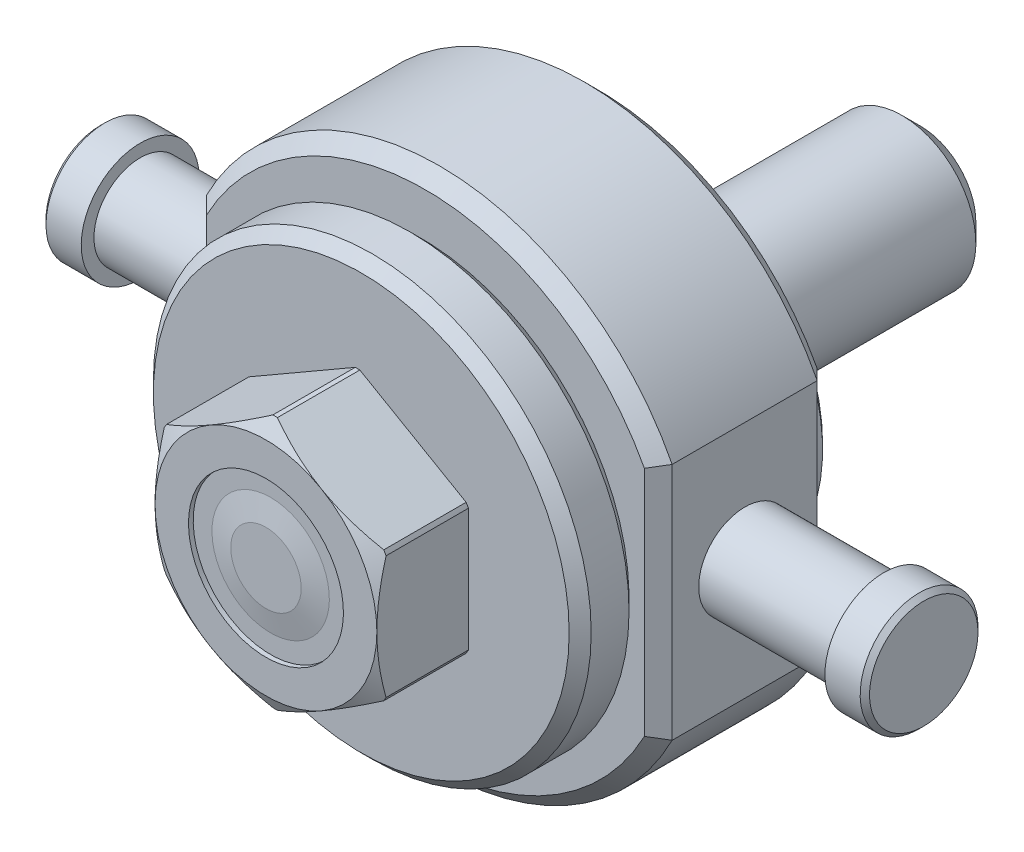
ISO-10303-21;
HEADER;
FILE_DESCRIPTION(('STEP AP214'),'2;1');
FILE_NAME('part.step','',(''),(''),'','','');
FILE_SCHEMA(('AUTOMOTIVE_DESIGN { 1 0 10303 214 1 1 1 1 }'));
ENDSEC;
DATA;
#1=APPLICATION_CONTEXT('core data for automotive mechanical design processes');
#2=APPLICATION_PROTOCOL_DEFINITION('international standard','automotive_design',2000,#1);
#3=PRODUCT_CONTEXT('',#1,'mechanical');
#4=PRODUCT('Part','Part','',(#3));
#5=PRODUCT_RELATED_PRODUCT_CATEGORY('part','',(#4));
#6=PRODUCT_DEFINITION_FORMATION('','',#4);
#7=PRODUCT_DEFINITION_CONTEXT('part definition',#1,'design');
#8=PRODUCT_DEFINITION('design','',#6,#7);
#9=PRODUCT_DEFINITION_SHAPE('','',#8);
#10=(LENGTH_UNIT() NAMED_UNIT(*) SI_UNIT(.MILLI.,.METRE.));
#11=(NAMED_UNIT(*) PLANE_ANGLE_UNIT() SI_UNIT($,.RADIAN.));
#12=(NAMED_UNIT(*) SI_UNIT($,.STERADIAN.) SOLID_ANGLE_UNIT());
#13=UNCERTAINTY_MEASURE_WITH_UNIT(LENGTH_MEASURE(1.E-05),#10,'distance_accuracy_value','');
#14=(GEOMETRIC_REPRESENTATION_CONTEXT(3) GLOBAL_UNCERTAINTY_ASSIGNED_CONTEXT((#13)) GLOBAL_UNIT_ASSIGNED_CONTEXT((#10,
#11,#12)) REPRESENTATION_CONTEXT('',''));
#15=CARTESIAN_POINT('',(0.,0.,0.));
#16=DIRECTION('',(0.,0.,1.));
#17=DIRECTION('',(1.,0.,0.));
#18=AXIS2_PLACEMENT_3D('',#15,#16,#17);
#19=CARTESIAN_POINT('',(-25.2,0.,42.0370641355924));
#20=DIRECTION('',(-1.,0.,0.));
#21=DIRECTION('',(0.,0.,1.));
#22=AXIS2_PLACEMENT_3D('',#19,#20,#21);
#23=PLANE('',#22);
#24=DIRECTION('',(0.,0.,-1.));
#25=VECTOR('',#24,1.);
#26=CARTESIAN_POINT('',(-25.2,-12.9243584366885,24.5618));
#27=LINE('',#26,#25);
#28=CARTESIAN_POINT('',(-25.2,-12.9243584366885,7.3674));
#29=VERTEX_POINT('',#28);
#30=CARTESIAN_POINT('',(-25.2,-12.9243584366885,23.0618));
#31=VERTEX_POINT('',#30);
#32=EDGE_CURVE('E180',#29,#31,#27,.F.);
#33=ORIENTED_EDGE('',*,*,#32,.T.);
#34=DIRECTION('',(0.,1.,0.));
#35=VECTOR('',#34,1.);
#36=CARTESIAN_POINT('',(-25.2,0.,23.0618));
#37=LINE('',#36,#35);
#38=CARTESIAN_POINT('',(-25.2,12.9243584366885,23.0618));
#39=VERTEX_POINT('',#38);
#40=EDGE_CURVE('E9',#31,#39,#37,.T.);
#41=ORIENTED_EDGE('',*,*,#40,.T.);
#42=DIRECTION('',(0.,0.,-1.));
#43=VECTOR('',#42,1.);
#44=CARTESIAN_POINT('',(-25.2,12.9243584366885,24.5618));
#45=LINE('',#44,#43);
#46=CARTESIAN_POINT('',(-25.2,12.9243584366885,7.3674));
#47=VERTEX_POINT('',#46);
#48=EDGE_CURVE('E183',#47,#39,#45,.F.);
#49=ORIENTED_EDGE('',*,*,#48,.F.);
#50=DIRECTION('',(0.,-1.,0.));
#51=VECTOR('',#50,1.);
#52=CARTESIAN_POINT('',(-25.2,-9.1829211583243,7.3674));
#53=LINE('',#52,#51);
#54=EDGE_CURVE('E23',#47,#29,#53,.T.);
#55=ORIENTED_EDGE('',*,*,#54,.T.);
#56=EDGE_LOOP('',(#33,#41,#49,#55));
#57=FACE_BOUND('',#56,.T.);
#58=CARTESIAN_POINT('',(-25.2,0.,15.1892));
#59=DIRECTION('',(-1.,0.,0.));
#60=DIRECTION('',(0.,0.,1.));
#61=AXIS2_PLACEMENT_3D('',#58,#59,#60);
#62=CIRCLE('',#61,5.);
#63=CARTESIAN_POINT('',(-25.2,0.,20.1892));
#64=VERTEX_POINT('',#63);
#65=EDGE_CURVE('E629',#64,#64,#62,.F.);
#66=ORIENTED_EDGE('',*,*,#65,.T.);
#67=EDGE_LOOP('',(#66));
#68=FACE_BOUND('',#67,.T.);
#69=ADVANCED_FACE('F14',(#57,#68),#23,.T.);
#70=CARTESIAN_POINT('',(25.2,0.,42.0370641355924));
#71=DIRECTION('',(1.,0.,0.));
#72=DIRECTION('',(0.,0.,-1.));
#73=AXIS2_PLACEMENT_3D('',#70,#71,#72);
#74=PLANE('',#73);
#75=DIRECTION('',(0.,0.,-1.));
#76=VECTOR('',#75,1.);
#77=CARTESIAN_POINT('',(25.2,12.9243584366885,24.5618));
#78=LINE('',#77,#76);
#79=CARTESIAN_POINT('',(25.2,12.9243584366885,23.0618));
#80=VERTEX_POINT('',#79);
#81=CARTESIAN_POINT('',(25.2,12.9243584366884,7.3674));
#82=VERTEX_POINT('',#81);
#83=EDGE_CURVE('E626',#80,#82,#78,.T.);
#84=ORIENTED_EDGE('',*,*,#83,.F.);
#85=DIRECTION('',(0.,-1.,0.));
#86=VECTOR('',#85,1.);
#87=CARTESIAN_POINT('',(25.2,0.,23.0618));
#88=LINE('',#87,#86);
#89=CARTESIAN_POINT('',(25.2,-12.9243584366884,23.0618));
#90=VERTEX_POINT('',#89);
#91=EDGE_CURVE('E607',#80,#90,#88,.T.);
#92=ORIENTED_EDGE('',*,*,#91,.T.);
#93=DIRECTION('',(0.,0.,-1.));
#94=VECTOR('',#93,1.);
#95=CARTESIAN_POINT('',(25.2,-12.9243584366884,24.5618));
#96=LINE('',#95,#94);
#97=CARTESIAN_POINT('',(25.2,-12.9243584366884,7.3674));
#98=VERTEX_POINT('',#97);
#99=EDGE_CURVE('E193',#90,#98,#96,.T.);
#100=ORIENTED_EDGE('',*,*,#99,.T.);
#101=DIRECTION('',(0.,1.,0.));
#102=VECTOR('',#101,1.);
#103=CARTESIAN_POINT('',(25.2,9.18292115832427,7.3674));
#104=LINE('',#103,#102);
#105=EDGE_CURVE('E639',#98,#82,#104,.T.);
#106=ORIENTED_EDGE('',*,*,#105,.T.);
#107=EDGE_LOOP('',(#84,#92,#100,#106));
#108=FACE_BOUND('',#107,.T.);
#109=CARTESIAN_POINT('',(25.2,0.,15.1892));
#110=DIRECTION('',(1.,0.,0.));
#111=DIRECTION('',(0.,0.,-1.));
#112=AXIS2_PLACEMENT_3D('',#109,#110,#111);
#113=CIRCLE('',#112,5.);
#114=CARTESIAN_POINT('',(25.2,0.,10.1892));
#115=VERTEX_POINT('',#114);
#116=EDGE_CURVE('E632',#115,#115,#113,.F.);
#117=ORIENTED_EDGE('',*,*,#116,.T.);
#118=EDGE_LOOP('',(#117));
#119=FACE_BOUND('',#118,.T.);
#120=ADVANCED_FACE('F535',(#108,#119),#74,.T.);
#121=CARTESIAN_POINT('',(-58.693735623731,0.,15.1892));
#122=DIRECTION('',(1.,0.,0.));
#123=DIRECTION('',(0.,1.,0.));
#124=AXIS2_PLACEMENT_3D('',#121,#122,#123);
#125=CYLINDRICAL_SURFACE('',#124,5.);
#126=CARTESIAN_POINT('',(-40.2336,0.,15.1892));
#127=DIRECTION('',(1.,0.,0.));
#128=DIRECTION('',(0.,1.,0.));
#129=AXIS2_PLACEMENT_3D('',#126,#127,#128);
#130=CIRCLE('',#129,5.);
#131=CARTESIAN_POINT('',(-40.2336,5.,15.1892));
#132=VERTEX_POINT('',#131);
#133=EDGE_CURVE('E217',#132,#132,#130,.T.);
#134=ORIENTED_EDGE('',*,*,#133,.T.);
#135=EDGE_LOOP('',(#134));
#136=FACE_BOUND('',#135,.T.);
#137=ORIENTED_EDGE('',*,*,#65,.F.);
#138=EDGE_LOOP('',(#137));
#139=FACE_BOUND('',#138,.T.);
#140=ADVANCED_FACE('F540',(#136,#139),#125,.T.);
#141=ORIENTED_EDGE('',*,*,#116,.F.);
#142=EDGE_LOOP('',(#141));
#143=FACE_BOUND('',#142,.T.);
#144=CARTESIAN_POINT('',(40.2336,0.,15.1892));
#145=DIRECTION('',(-1.,0.,0.));
#146=DIRECTION('',(0.,-1.,0.));
#147=AXIS2_PLACEMENT_3D('',#144,#145,#146);
#148=CIRCLE('',#147,5.);
#149=CARTESIAN_POINT('',(40.2336,-4.99999999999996,15.1892));
#150=VERTEX_POINT('',#149);
#151=EDGE_CURVE('E214',#150,#150,#148,.T.);
#152=ORIENTED_EDGE('',*,*,#151,.T.);
#153=EDGE_LOOP('',(#152));
#154=FACE_BOUND('',#153,.T.);
#155=ADVANCED_FACE('F839',(#143,#154),#125,.T.);
#156=CARTESIAN_POINT('',(0.,0.,24.5618));
#157=DIRECTION('',(0.,0.,1.));
#158=DIRECTION('',(0.,-1.,0.));
#159=AXIS2_PLACEMENT_3D('',#156,#157,#158);
#160=PLANE('',#159);
#161=CARTESIAN_POINT('',(0.,0.,24.5618));
#162=DIRECTION('',(0.,0.,1.));
#163=DIRECTION('',(1.,0.,0.));
#164=AXIS2_PLACEMENT_3D('',#161,#162,#163);
#165=CIRCLE('',#164,26.821);
#166=CARTESIAN_POINT('',(-23.7,-12.5569120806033,24.5618));
#167=VERTEX_POINT('',#166);
#168=CARTESIAN_POINT('',(23.7,-12.5569120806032,24.5618));
#169=VERTEX_POINT('',#168);
#170=EDGE_CURVE('E210',#167,#169,#165,.T.);
#171=ORIENTED_EDGE('',*,*,#170,.T.);
#172=DIRECTION('',(0.,1.,0.));
#173=VECTOR('',#172,1.);
#174=CARTESIAN_POINT('',(23.7,0.,24.5618));
#175=LINE('',#174,#173);
#176=CARTESIAN_POINT('',(23.7,12.5569120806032,24.5618));
#177=VERTEX_POINT('',#176);
#178=EDGE_CURVE('E647',#169,#177,#175,.T.);
#179=ORIENTED_EDGE('',*,*,#178,.T.);
#180=CARTESIAN_POINT('',(-23.7,12.5569120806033,24.5618));
#181=VERTEX_POINT('',#180);
#182=EDGE_CURVE('E207',#177,#181,#165,.T.);
#183=ORIENTED_EDGE('',*,*,#182,.T.);
#184=DIRECTION('',(0.,-1.,0.));
#185=VECTOR('',#184,1.);
#186=CARTESIAN_POINT('',(-23.7,0.,24.5618));
#187=LINE('',#186,#185);
#188=EDGE_CURVE('E649',#181,#167,#187,.T.);
#189=ORIENTED_EDGE('',*,*,#188,.T.);
#190=EDGE_LOOP('',(#171,#179,#183,#189));
#191=FACE_BOUND('',#190,.T.);
#192=CARTESIAN_POINT('',(0.,0.,24.5618));
#193=DIRECTION('',(0.,0.,-1.));
#194=DIRECTION('',(0.,1.,0.));
#195=AXIS2_PLACEMENT_3D('',#192,#193,#194);
#196=CIRCLE('',#195,12.4079);
#197=CARTESIAN_POINT('',(0.,12.4079,24.5618));
#198=VERTEX_POINT('',#197);
#199=EDGE_CURVE('E343',#198,#198,#196,.T.);
#200=ORIENTED_EDGE('',*,*,#199,.T.);
#201=EDGE_LOOP('',(#200));
#202=FACE_BOUND('',#201,.T.);
#203=ADVANCED_FACE('F841',(#191,#202),#160,.T.);
#204=CARTESIAN_POINT('',(0.,0.,23.0618));
#205=DIRECTION('',(0.,0.,-1.));
#206=DIRECTION('',(-1.,0.,0.));
#207=AXIS2_PLACEMENT_3D('',#204,#205,#206);
#208=CONICAL_SURFACE('',#207,28.321,0.785398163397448);
#209=ORIENTED_EDGE('',*,*,#182,.F.);
#210=CARTESIAN_POINT('',(23.7,12.5569120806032,24.5618));
#211=CARTESIAN_POINT('',(23.9498950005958,12.6190104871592,24.3119049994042));
#212=CARTESIAN_POINT('',(24.1998425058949,12.6806802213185,24.0619574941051));
#213=CARTESIAN_POINT('',(24.6998425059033,12.803162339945,23.5619574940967));
#214=CARTESIAN_POINT('',(24.9498950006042,12.8639747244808,23.3119049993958));
#215=CARTESIAN_POINT('',(25.2,12.9243584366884,23.0618));
#216=B_SPLINE_CURVE_WITH_KNOTS('',3,(#210,#211,#212,#213,#214,#215),.UNSPECIFIED.,.F.,.F.,(4,2,
4),(0.,1.07645529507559,2.15291050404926),.UNSPECIFIED.);
#217=EDGE_CURVE('E640',#177,#80,#216,.T.);
#218=ORIENTED_EDGE('',*,*,#217,.T.);
#219=CARTESIAN_POINT('',(0.,0.,23.0618));
#220=DIRECTION('',(0.,0.,1.));
#221=DIRECTION('',(1.,0.,0.));
#222=AXIS2_PLACEMENT_3D('',#219,#220,#221);
#223=CIRCLE('',#222,28.321);
#224=EDGE_CURVE('E197',#80,#39,#223,.T.);
#225=ORIENTED_EDGE('',*,*,#224,.T.);
#226=CARTESIAN_POINT('',(-25.2,12.9243584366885,23.0618));
#227=CARTESIAN_POINT('',(-24.9498950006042,12.8639747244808,23.3119049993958));
#228=CARTESIAN_POINT('',(-24.6998425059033,12.803162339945,23.5619574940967));
#229=CARTESIAN_POINT('',(-24.1998425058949,12.6806802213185,24.0619574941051));
#230=CARTESIAN_POINT('',(-23.9498950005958,12.6190104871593,24.3119049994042));
#231=CARTESIAN_POINT('',(-23.7,12.5569120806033,24.5618));
#232=B_SPLINE_CURVE_WITH_KNOTS('',3,(#226,#227,#228,#229,#230,#231),.UNSPECIFIED.,.F.,.F.,(4,2,
4),(0.,1.07645520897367,2.15291050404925),.UNSPECIFIED.);
#233=EDGE_CURVE('E592',#39,#181,#232,.T.);
#234=ORIENTED_EDGE('',*,*,#233,.T.);
#235=EDGE_LOOP('',(#209,#218,#225,#234));
#236=FACE_BOUND('',#235,.T.);
#237=ADVANCED_FACE('F550',(#236),#208,.T.);
#238=EDGE_CURVE('E191',#31,#90,#223,.T.);
#239=ORIENTED_EDGE('',*,*,#238,.T.);
#240=CARTESIAN_POINT('',(25.2,-12.9243584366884,23.0618));
#241=CARTESIAN_POINT('',(24.9498950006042,-12.8639747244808,23.3119049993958));
#242=CARTESIAN_POINT('',(24.6998425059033,-12.803162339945,23.5619574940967));
#243=CARTESIAN_POINT('',(24.1998425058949,-12.6806802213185,24.0619574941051));
#244=CARTESIAN_POINT('',(23.9498950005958,-12.6190104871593,24.3119049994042));
#245=CARTESIAN_POINT('',(23.7,-12.5569120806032,24.5618));
#246=B_SPLINE_CURVE_WITH_KNOTS('',3,(#240,#241,#242,#243,#244,#245),.UNSPECIFIED.,.F.,.F.,(4,2,
4),(0.,1.07645520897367,2.15291050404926),.UNSPECIFIED.);
#247=EDGE_CURVE('E606',#90,#169,#246,.T.);
#248=ORIENTED_EDGE('',*,*,#247,.T.);
#249=ORIENTED_EDGE('',*,*,#170,.F.);
#250=CARTESIAN_POINT('',(-23.7,-12.5569120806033,24.5618));
#251=CARTESIAN_POINT('',(-23.9498950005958,-12.6190104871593,24.3119049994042));
#252=CARTESIAN_POINT('',(-24.1998425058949,-12.6806802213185,24.0619574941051));
#253=CARTESIAN_POINT('',(-24.6998425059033,-12.803162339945,23.5619574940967));
#254=CARTESIAN_POINT('',(-24.9498950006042,-12.8639747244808,23.3119049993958));
#255=CARTESIAN_POINT('',(-25.2,-12.9243584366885,23.0618));
#256=B_SPLINE_CURVE_WITH_KNOTS('',3,(#250,#251,#252,#253,#254,#255),.UNSPECIFIED.,.F.,.F.,(4,2,
4),(0.,1.07645529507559,2.15291050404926),.UNSPECIFIED.);
#257=EDGE_CURVE('E600',#167,#31,#256,.T.);
#258=ORIENTED_EDGE('',*,*,#257,.T.);
#259=EDGE_LOOP('',(#239,#248,#249,#258));
#260=FACE_BOUND('',#259,.T.);
#261=ADVANCED_FACE('F548',(#260),#208,.T.);
#262=CARTESIAN_POINT('',(0.,0.,5.8674));
#263=DIRECTION('',(0.,0.,1.));
#264=DIRECTION('',(1.,0.,0.));
#265=AXIS2_PLACEMENT_3D('',#262,#263,#264);
#266=CONICAL_SURFACE('',#265,26.821,0.785398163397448);
#267=CARTESIAN_POINT('',(0.,0.,7.3674));
#268=DIRECTION('',(0.,0.,1.));
#269=DIRECTION('',(1.,0.,0.));
#270=AXIS2_PLACEMENT_3D('',#267,#268,#269);
#271=CIRCLE('',#270,28.321);
#272=EDGE_CURVE('E198',#82,#47,#271,.T.);
#273=ORIENTED_EDGE('',*,*,#272,.F.);
#274=CARTESIAN_POINT('',(25.2,12.9243584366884,7.3674));
#275=CARTESIAN_POINT('',(24.9498950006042,12.8639747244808,7.11729500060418));
#276=CARTESIAN_POINT('',(24.6998425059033,12.803162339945,6.86724250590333));
#277=CARTESIAN_POINT('',(24.1998425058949,12.6806802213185,6.36724250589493));
#278=CARTESIAN_POINT('',(23.9498950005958,12.6190104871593,6.11729500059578));
#279=CARTESIAN_POINT('',(23.7,12.5569120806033,5.8674));
#280=B_SPLINE_CURVE_WITH_KNOTS('',3,(#274,#275,#276,#277,#278,#279),.UNSPECIFIED.,.F.,.F.,(4,2,
4),(0.,1.07645520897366,2.15291050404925),.UNSPECIFIED.);
#281=CARTESIAN_POINT('',(23.7,12.5569120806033,5.8674));
#282=VERTEX_POINT('',#281);
#283=EDGE_CURVE('E570',#82,#282,#280,.T.);
#284=ORIENTED_EDGE('',*,*,#283,.T.);
#285=CARTESIAN_POINT('',(0.,0.,5.8674));
#286=DIRECTION('',(0.,0.,1.));
#287=DIRECTION('',(1.,0.,0.));
#288=AXIS2_PLACEMENT_3D('',#285,#286,#287);
#289=CIRCLE('',#288,26.821);
#290=CARTESIAN_POINT('',(-23.7,12.5569120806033,5.8674));
#291=VERTEX_POINT('',#290);
#292=EDGE_CURVE('E619',#282,#291,#289,.T.);
#293=ORIENTED_EDGE('',*,*,#292,.T.);
#294=CARTESIAN_POINT('',(-23.7,12.5569120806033,5.8674));
#295=CARTESIAN_POINT('',(-23.9498950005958,12.6190104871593,6.11729500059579));
#296=CARTESIAN_POINT('',(-24.1998425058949,12.6806802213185,6.36724250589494));
#297=CARTESIAN_POINT('',(-24.6998425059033,12.803162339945,6.86724250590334));
#298=CARTESIAN_POINT('',(-24.9498950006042,12.8639747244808,7.11729500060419));
#299=CARTESIAN_POINT('',(-25.2,12.9243584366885,7.3674));
#300=B_SPLINE_CURVE_WITH_KNOTS('',3,(#294,#295,#296,#297,#298,#299),.UNSPECIFIED.,.F.,.F.,(4,2,
4),(0.,1.07645529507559,2.15291050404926),.UNSPECIFIED.);
#301=EDGE_CURVE('E563',#291,#47,#300,.T.);
#302=ORIENTED_EDGE('',*,*,#301,.T.);
#303=EDGE_LOOP('',(#273,#284,#293,#302));
#304=FACE_BOUND('',#303,.T.);
#305=ADVANCED_FACE('F544',(#304),#266,.T.);
#306=CARTESIAN_POINT('',(-23.7,-12.5569120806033,5.8674));
#307=VERTEX_POINT('',#306);
#308=CARTESIAN_POINT('',(23.7,-12.5569120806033,5.8674));
#309=VERTEX_POINT('',#308);
#310=EDGE_CURVE('E203',#307,#309,#289,.T.);
#311=ORIENTED_EDGE('',*,*,#310,.T.);
#312=CARTESIAN_POINT('',(23.7,-12.5569120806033,5.8674));
#313=CARTESIAN_POINT('',(23.9498950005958,-12.6190104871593,6.11729500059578));
#314=CARTESIAN_POINT('',(24.1998425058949,-12.6806802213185,6.36724250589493));
#315=CARTESIAN_POINT('',(24.6998425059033,-12.803162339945,6.86724250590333));
#316=CARTESIAN_POINT('',(24.9498950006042,-12.8639747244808,7.11729500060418));
#317=CARTESIAN_POINT('',(25.2,-12.9243584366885,7.3674));
#318=B_SPLINE_CURVE_WITH_KNOTS('',3,(#312,#313,#314,#315,#316,#317),.UNSPECIFIED.,.F.,.F.,(4,2,
4),(0.,1.07645529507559,2.15291050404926),.UNSPECIFIED.);
#319=EDGE_CURVE('E173',#309,#98,#318,.T.);
#320=ORIENTED_EDGE('',*,*,#319,.T.);
#321=EDGE_CURVE('E188',#29,#98,#271,.T.);
#322=ORIENTED_EDGE('',*,*,#321,.F.);
#323=CARTESIAN_POINT('',(-25.2,-12.9243584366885,7.3674));
#324=CARTESIAN_POINT('',(-24.9498950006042,-12.8639747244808,7.11729500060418));
#325=CARTESIAN_POINT('',(-24.6998425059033,-12.803162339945,6.86724250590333));
#326=CARTESIAN_POINT('',(-24.1998425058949,-12.6806802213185,6.36724250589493));
#327=CARTESIAN_POINT('',(-23.9498950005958,-12.6190104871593,6.11729500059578));
#328=CARTESIAN_POINT('',(-23.7,-12.5569120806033,5.8674));
#329=B_SPLINE_CURVE_WITH_KNOTS('',3,(#323,#324,#325,#326,#327,#328),.UNSPECIFIED.,.F.,.F.,(4,2,
4),(0.,1.07645520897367,2.15291050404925),.UNSPECIFIED.);
#330=EDGE_CURVE('E37',#29,#307,#329,.T.);
#331=ORIENTED_EDGE('',*,*,#330,.T.);
#332=EDGE_LOOP('',(#311,#320,#322,#331));
#333=FACE_BOUND('',#332,.T.);
#334=ADVANCED_FACE('F195',(#333),#266,.T.);
#335=CARTESIAN_POINT('',(0.,0.,24.5618));
#336=DIRECTION('',(0.,0.,-1.));
#337=DIRECTION('',(0.,1.,0.));
#338=AXIS2_PLACEMENT_3D('',#335,#336,#337);
#339=CYLINDRICAL_SURFACE('',#338,28.321);
#340=ORIENTED_EDGE('',*,*,#224,.F.);
#341=ORIENTED_EDGE('',*,*,#83,.T.);
#342=ORIENTED_EDGE('',*,*,#272,.T.);
#343=ORIENTED_EDGE('',*,*,#48,.T.);
#344=EDGE_LOOP('',(#340,#341,#342,#343));
#345=FACE_BOUND('',#344,.T.);
#346=ADVANCED_FACE('F623',(#345),#339,.T.);
#347=ORIENTED_EDGE('',*,*,#32,.F.);
#348=ORIENTED_EDGE('',*,*,#321,.T.);
#349=ORIENTED_EDGE('',*,*,#99,.F.);
#350=ORIENTED_EDGE('',*,*,#238,.F.);
#351=EDGE_LOOP('',(#347,#348,#349,#350));
#352=FACE_BOUND('',#351,.T.);
#353=ADVANCED_FACE('F186',(#352),#339,.T.);
#354=CARTESIAN_POINT('',(0.,0.,5.8674));
#355=DIRECTION('',(0.,0.,1.));
#356=DIRECTION('',(0.,-1.,0.));
#357=AXIS2_PLACEMENT_3D('',#354,#355,#356);
#358=PLANE('',#357);
#359=CARTESIAN_POINT('',(0.,0.,5.8674));
#360=DIRECTION('',(0.,0.,-1.));
#361=DIRECTION('',(0.,1.,0.));
#362=AXIS2_PLACEMENT_3D('',#359,#360,#361);
#363=CIRCLE('',#362,18.415);
#364=CARTESIAN_POINT('',(0.,18.415,5.8674));
#365=VERTEX_POINT('',#364);
#366=EDGE_CURVE('E225',#365,#365,#363,.T.);
#367=ORIENTED_EDGE('',*,*,#366,.F.);
#368=EDGE_LOOP('',(#367));
#369=FACE_BOUND('',#368,.T.);
#370=ORIENTED_EDGE('',*,*,#292,.F.);
#371=DIRECTION('',(0.,-1.,0.));
#372=VECTOR('',#371,1.);
#373=CARTESIAN_POINT('',(23.7,-9.18292115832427,5.8674));
#374=LINE('',#373,#372);
#375=EDGE_CURVE('E30',#282,#309,#374,.T.);
#376=ORIENTED_EDGE('',*,*,#375,.T.);
#377=ORIENTED_EDGE('',*,*,#310,.F.);
#378=DIRECTION('',(0.,1.,0.));
#379=VECTOR('',#378,1.);
#380=CARTESIAN_POINT('',(-23.7,9.1829211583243,5.8674));
#381=LINE('',#380,#379);
#382=EDGE_CURVE('E172',#307,#291,#381,.T.);
#383=ORIENTED_EDGE('',*,*,#382,.T.);
#384=EDGE_LOOP('',(#370,#376,#377,#383));
#385=FACE_BOUND('',#384,.T.);
#386=ADVANCED_FACE('F753',(#369,#385),#358,.F.);
#387=CARTESIAN_POINT('',(12.0015,0.,41.8084));
#388=DIRECTION('',(0.,0.,-1.));
#389=DIRECTION('',(0.,1.,0.));
#390=AXIS2_PLACEMENT_3D('',#387,#388,#389);
#391=PLANE('',#390);
#392=CARTESIAN_POINT('',(0.,0.,41.8084000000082));
#393=DIRECTION('',(0.,0.,-1.));
#394=DIRECTION('',(0.,1.,0.));
#395=AXIS2_PLACEMENT_3D('',#392,#393,#394);
#396=CIRCLE('',#395,3.80999999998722);
#397=CARTESIAN_POINT('',(0.,3.80999999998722,41.8084000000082));
#398=VERTEX_POINT('',#397);
#399=EDGE_CURVE('E220',#398,#398,#396,.T.);
#400=ORIENTED_EDGE('',*,*,#399,.F.);
#401=EDGE_LOOP('',(#400));
#402=FACE_BOUND('',#401,.T.);
#403=ADVANCED_FACE('F520',(#402),#391,.F.);
#404=CARTESIAN_POINT('',(0.,0.,41.3004000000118));
#405=DIRECTION('',(0.,0.,-1.));
#406=DIRECTION('',(0.,1.,0.));
#407=AXIS2_PLACEMENT_3D('',#404,#405,#406);
#408=CONICAL_SURFACE('',#407,6.34999999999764,1.37340076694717);
#409=ORIENTED_EDGE('',*,*,#399,.T.);
#410=EDGE_LOOP('',(#409));
#411=FACE_BOUND('',#410,.T.);
#412=CARTESIAN_POINT('',(0.,0.,41.3004000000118));
#413=DIRECTION('',(0.,0.,-1.));
#414=DIRECTION('',(0.,1.,0.));
#415=AXIS2_PLACEMENT_3D('',#412,#413,#414);
#416=CIRCLE('',#415,6.34999999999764);
#417=CARTESIAN_POINT('',(0.,6.34999999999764,41.3004000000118));
#418=VERTEX_POINT('',#417);
#419=EDGE_CURVE('E662',#418,#418,#416,.T.);
#420=ORIENTED_EDGE('',*,*,#419,.F.);
#421=EDGE_LOOP('',(#420));
#422=FACE_BOUND('',#421,.T.);
#423=ADVANCED_FACE('F743',(#411,#422),#408,.T.);
#424=CARTESIAN_POINT('',(0.,-6.35,41.3004));
#425=DIRECTION('',(0.,0.,1.));
#426=DIRECTION('',(0.,-1.,0.));
#427=AXIS2_PLACEMENT_3D('',#424,#425,#426);
#428=PLANE('',#427);
#429=CARTESIAN_POINT('',(0.,0.,41.3004));
#430=DIRECTION('',(0.,0.,-1.));
#431=DIRECTION('',(0.,1.,0.));
#432=AXIS2_PLACEMENT_3D('',#429,#430,#431);
#433=CIRCLE('',#432,8.382);
#434=CARTESIAN_POINT('',(0.,8.382,41.3004));
#435=VERTEX_POINT('',#434);
#436=EDGE_CURVE('E665',#435,#435,#433,.F.);
#437=ORIENTED_EDGE('',*,*,#436,.T.);
#438=EDGE_LOOP('',(#437));
#439=FACE_BOUND('',#438,.T.);
#440=ORIENTED_EDGE('',*,*,#419,.T.);
#441=EDGE_LOOP('',(#440));
#442=FACE_BOUND('',#441,.T.);
#443=ADVANCED_FACE('F738',(#439,#442),#428,.T.);
#444=CARTESIAN_POINT('',(0.,0.,2.667));
#445=DIRECTION('',(0.,0.,-1.));
#446=DIRECTION('',(0.,1.,0.));
#447=AXIS2_PLACEMENT_3D('',#444,#445,#446);
#448=CYLINDRICAL_SURFACE('',#447,8.382);
#449=CARTESIAN_POINT('',(0.,0.,41.8084));
#450=DIRECTION('',(0.,0.,-1.));
#451=DIRECTION('',(0.,1.,0.));
#452=AXIS2_PLACEMENT_3D('',#449,#450,#451);
#453=CIRCLE('',#452,8.382);
#454=CARTESIAN_POINT('',(0.,8.382,41.8084));
#455=VERTEX_POINT('',#454);
#456=EDGE_CURVE('E668',#455,#455,#453,.F.);
#457=ORIENTED_EDGE('',*,*,#456,.T.);
#458=EDGE_LOOP('',(#457));
#459=FACE_BOUND('',#458,.T.);
#460=ORIENTED_EDGE('',*,*,#436,.F.);
#461=EDGE_LOOP('',(#460));
#462=FACE_BOUND('',#461,.T.);
#463=ADVANCED_FACE('F733',(#459,#462),#448,.F.);
#464=CARTESIAN_POINT('',(12.0015,0.,41.8084));
#465=DIRECTION('',(0.,0.,-1.));
#466=DIRECTION('',(0.,1.,0.));
#467=AXIS2_PLACEMENT_3D('',#464,#465,#466);
#468=PLANE('',#467);
#469=CARTESIAN_POINT('',(0.,0.,41.8084));
#470=DIRECTION('',(0.,0.,-1.));
#471=DIRECTION('',(0.,1.,0.));
#472=AXIS2_PLACEMENT_3D('',#469,#470,#471);
#473=CIRCLE('',#472,12.0015);
#474=CARTESIAN_POINT('',(6.00075,10.3936038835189,41.8084));
#475=VERTEX_POINT('',#474);
#476=CARTESIAN_POINT('',(12.0015,0.,41.8084));
#477=VERTEX_POINT('',#476);
#478=EDGE_CURVE('E322',#475,#477,#473,.T.);
#479=ORIENTED_EDGE('',*,*,#478,.F.);
#480=CARTESIAN_POINT('',(0.,0.,41.8084));
#481=DIRECTION('',(0.,0.,-1.));
#482=DIRECTION('',(0.,1.,0.));
#483=AXIS2_PLACEMENT_3D('',#480,#481,#482);
#484=CIRCLE('',#483,12.0015);
#485=CARTESIAN_POINT('',(-6.00075,10.3936038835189,41.8084));
#486=VERTEX_POINT('',#485);
#487=EDGE_CURVE('E684',#486,#475,#484,.T.);
#488=ORIENTED_EDGE('',*,*,#487,.F.);
#489=CARTESIAN_POINT('',(0.,0.,41.8084));
#490=DIRECTION('',(0.,0.,-1.));
#491=DIRECTION('',(0.,1.,0.));
#492=AXIS2_PLACEMENT_3D('',#489,#490,#491);
#493=CIRCLE('',#492,12.0015);
#494=CARTESIAN_POINT('',(-12.0015,0.,41.8084));
#495=VERTEX_POINT('',#494);
#496=EDGE_CURVE('E342',#495,#486,#493,.T.);
#497=ORIENTED_EDGE('',*,*,#496,.F.);
#498=CARTESIAN_POINT('',(0.,0.,41.8084));
#499=DIRECTION('',(0.,0.,-1.));
#500=DIRECTION('',(0.,1.,0.));
#501=AXIS2_PLACEMENT_3D('',#498,#499,#500);
#502=CIRCLE('',#501,12.0015);
#503=CARTESIAN_POINT('',(-6.00075,-10.3936038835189,41.8084));
#504=VERTEX_POINT('',#503);
#505=EDGE_CURVE('E337',#504,#495,#502,.T.);
#506=ORIENTED_EDGE('',*,*,#505,.F.);
#507=CARTESIAN_POINT('',(0.,0.,41.8084));
#508=DIRECTION('',(0.,0.,-1.));
#509=DIRECTION('',(0.,1.,0.));
#510=AXIS2_PLACEMENT_3D('',#507,#508,#509);
#511=CIRCLE('',#510,12.0015);
#512=CARTESIAN_POINT('',(6.00075,-10.3936038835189,41.8084));
#513=VERTEX_POINT('',#512);
#514=EDGE_CURVE('E677',#513,#504,#511,.T.);
#515=ORIENTED_EDGE('',*,*,#514,.F.);
#516=CARTESIAN_POINT('',(0.,0.,41.8084));
#517=DIRECTION('',(0.,0.,-1.));
#518=DIRECTION('',(0.,1.,0.));
#519=AXIS2_PLACEMENT_3D('',#516,#517,#518);
#520=CIRCLE('',#519,12.0015);
#521=EDGE_CURVE('E327',#477,#513,#520,.T.);
#522=ORIENTED_EDGE('',*,*,#521,.F.);
#523=EDGE_LOOP('',(#479,#488,#497,#506,#515,#522));
#524=FACE_BOUND('',#523,.T.);
#525=ORIENTED_EDGE('',*,*,#456,.F.);
#526=EDGE_LOOP('',(#525));
#527=FACE_BOUND('',#526,.T.);
#528=ADVANCED_FACE('F491',(#524,#527),#468,.F.);
#529=CARTESIAN_POINT('',(0.,0.,40.8185329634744));
#530=DIRECTION('',(0.,0.,-1.));
#531=DIRECTION('',(0.,1.,0.));
#532=AXIS2_PLACEMENT_3D('',#529,#530,#531);
#533=CONICAL_SURFACE('',#532,13.716,1.0471975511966);
#534=CARTESIAN_POINT('',(-11.7513578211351,7.07348890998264,40.8185329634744));
#535=CARTESIAN_POINT('',(-11.5169020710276,7.20885200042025,40.8941940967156));
#536=CARTESIAN_POINT('',(-11.2816639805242,7.34466677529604,40.9665811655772));
#537=CARTESIAN_POINT('',(-10.8095162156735,7.61726141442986,41.1040339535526));
#538=CARTESIAN_POINT('',(-10.5726060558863,7.75404155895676,41.1690974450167));
#539=CARTESIAN_POINT('',(-9.86179428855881,8.16442892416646,41.351466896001));
#540=CARTESIAN_POINT('',(-9.38547084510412,8.43943439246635,41.4567228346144));
#541=CARTESIAN_POINT('',(-8.66690634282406,8.85429780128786,41.5857173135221));
#542=CARTESIAN_POINT('',(-8.42656539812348,8.99305871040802,41.6239142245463));
#543=CARTESIAN_POINT('',(-7.94481060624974,9.27119996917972,41.6899850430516));
#544=CARTESIAN_POINT('',(-7.70339678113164,9.41058030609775,41.7178591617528));
#545=CARTESIAN_POINT('',(-7.21866664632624,9.69043937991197,41.762831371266));
#546=CARTESIAN_POINT('',(-6.97534673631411,9.83092019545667,41.7798779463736));
#547=CARTESIAN_POINT('',(-6.48827155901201,10.1121331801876,41.8026838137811));
#548=CARTESIAN_POINT('',(-6.24451622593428,10.2528653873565,41.808441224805));
#549=CARTESIAN_POINT('',(-6.00075,10.3936038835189,41.8084));
#550=B_SPLINE_CURVE_WITH_KNOTS('',3,(#534,#535,#536,#537,#538,#539,#540,#541,#542,#543,#544,
#545,#546,#547,#548,#549),.UNSPECIFIED.,.F.,.F.,(4,2,2,2,2,2,2,4),(0.,0.843245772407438,
1.68674734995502,3.36533020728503,4.20558976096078,5.04583212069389,5.89004284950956,
6.73439424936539),.UNSPECIFIED.);
#551=CARTESIAN_POINT('',(-11.7513578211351,7.07348890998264,40.8185329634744));
#552=VERTEX_POINT('',#551);
#553=EDGE_CURVE('E314',#552,#486,#550,.T.);
#554=ORIENTED_EDGE('',*,*,#553,.F.);
#555=CARTESIAN_POINT('',(0.,0.,40.8185329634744));
#556=DIRECTION('',(0.,0.,1.));
#557=DIRECTION('',(0.,-1.,0.));
#558=AXIS2_PLACEMENT_3D('',#555,#556,#557);
#559=CIRCLE('',#558,13.716);
#560=CARTESIAN_POINT('',(-12.0015,6.64022994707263,40.8185329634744));
#561=VERTEX_POINT('',#560);
#562=EDGE_CURVE('E338',#561,#552,#559,.F.);
#563=ORIENTED_EDGE('',*,*,#562,.F.);
#564=CARTESIAN_POINT('',(-12.0015,0.,41.8084));
#565=CARTESIAN_POINT('',(-12.0015,0.28147699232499,41.808441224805));
#566=CARTESIAN_POINT('',(-12.0015,0.562941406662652,41.8026838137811));
#567=CARTESIAN_POINT('',(-12.0015,1.12536737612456,41.7798779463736));
#568=CARTESIAN_POINT('',(-12.0015,1.40632900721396,41.762831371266));
#569=CARTESIAN_POINT('',(-12.0015,1.9660471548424,41.7178591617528));
#570=CARTESIAN_POINT('',(-12.0015,2.24480782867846,41.6899850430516));
#571=CARTESIAN_POINT('',(-12.0015,2.80109034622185,41.6239142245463));
#572=CARTESIAN_POINT('',(-12.0015,3.07861216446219,41.5857173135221));
#573=CARTESIAN_POINT('',(-12.0015,3.90833898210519,41.4567228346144));
#574=CARTESIAN_POINT('',(-12.0015,4.45834991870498,41.351466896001));
#575=CARTESIAN_POINT('',(-12.0015,5.27912464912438,41.1690974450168));
#576=CARTESIAN_POINT('',(-12.0015,5.55268493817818,41.1040339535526));
#577=CARTESIAN_POINT('',(-12.0015,6.09787421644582,40.9665811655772));
#578=CARTESIAN_POINT('',(-12.0015,6.3695037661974,40.8941940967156));
#579=CARTESIAN_POINT('',(-12.0015,6.64022994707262,40.8185329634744));
#580=B_SPLINE_CURVE_WITH_KNOTS('',3,(#564,#565,#566,#567,#568,#569,#570,#571,#572,#573,#574,
#575,#576,#577,#578,#579),.UNSPECIFIED.,.F.,.F.,(4,2,2,2,2,2,2,4),(0.,0.84435139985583,
1.6885621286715,2.52880448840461,3.36906404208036,5.04764689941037,5.89114847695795,
6.73439424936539),.UNSPECIFIED.);
#581=EDGE_CURVE('E302',#495,#561,#580,.T.);
#582=ORIENTED_EDGE('',*,*,#581,.F.);
#583=ORIENTED_EDGE('',*,*,#496,.T.);
#584=EDGE_LOOP('',(#554,#563,#582,#583));
#585=FACE_BOUND('',#584,.T.);
#586=ADVANCED_FACE('F485',(#585),#533,.T.);
#587=CARTESIAN_POINT('',(0.,0.,121.108609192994));
#588=DIRECTION('',(0.,0.,1.));
#589=DIRECTION('',(0.,-1.,0.));
#590=AXIS2_PLACEMENT_3D('',#587,#588,#589);
#591=CYLINDRICAL_SURFACE('',#590,13.716);
#592=DIRECTION('',(0.,0.,1.));
#593=VECTOR('',#592,1.);
#594=CARTESIAN_POINT('',(-11.7513578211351,7.07348890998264,-28.829));
#595=LINE('',#594,#593);
#596=CARTESIAN_POINT('',(-11.7513578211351,7.07348890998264,31.9024));
#597=VERTEX_POINT('',#596);
#598=EDGE_CURVE('E303',#597,#552,#595,.T.);
#599=ORIENTED_EDGE('',*,*,#598,.F.);
#600=CARTESIAN_POINT('',(0.,0.,31.9024));
#601=DIRECTION('',(0.,0.,1.));
#602=DIRECTION('',(0.,-1.,0.));
#603=AXIS2_PLACEMENT_3D('',#600,#601,#602);
#604=CIRCLE('',#603,13.716);
#605=CARTESIAN_POINT('',(-12.0015,6.64022994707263,31.9024));
#606=VERTEX_POINT('',#605);
#607=EDGE_CURVE('E341',#597,#606,#604,.T.);
#608=ORIENTED_EDGE('',*,*,#607,.T.);
#609=DIRECTION('',(0.,0.,1.));
#610=VECTOR('',#609,1.);
#611=CARTESIAN_POINT('',(-12.0015,6.64022994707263,-28.829));
#612=LINE('',#611,#610);
#613=EDGE_CURVE('E299',#561,#606,#612,.F.);
#614=ORIENTED_EDGE('',*,*,#613,.F.);
#615=ORIENTED_EDGE('',*,*,#562,.T.);
#616=EDGE_LOOP('',(#599,#608,#614,#615));
#617=FACE_BOUND('',#616,.T.);
#618=ADVANCED_FACE('F490',(#617),#591,.T.);
#619=CARTESIAN_POINT('',(0.,0.,40.8185329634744));
#620=DIRECTION('',(0.,0.,-1.));
#621=DIRECTION('',(0.,1.,0.));
#622=AXIS2_PLACEMENT_3D('',#619,#620,#621);
#623=CONICAL_SURFACE('',#622,13.716,1.0471975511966);
#624=CARTESIAN_POINT('',(-12.0015,-6.64022994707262,40.8185329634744));
#625=CARTESIAN_POINT('',(-12.0015,-6.3695037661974,40.8941940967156));
#626=CARTESIAN_POINT('',(-12.0015,-6.09787421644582,40.9665811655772));
#627=CARTESIAN_POINT('',(-12.0015,-5.55268493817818,41.1040339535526));
#628=CARTESIAN_POINT('',(-12.0015,-5.27912464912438,41.1690974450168));
#629=CARTESIAN_POINT('',(-12.0015,-4.45834991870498,41.351466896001));
#630=CARTESIAN_POINT('',(-12.0015,-3.90833898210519,41.4567228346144));
#631=CARTESIAN_POINT('',(-12.0015,-3.07861216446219,41.5857173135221));
#632=CARTESIAN_POINT('',(-12.0015,-2.80109034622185,41.6239142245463));
#633=CARTESIAN_POINT('',(-12.0015,-2.24480782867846,41.6899850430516));
#634=CARTESIAN_POINT('',(-12.0015,-1.9660471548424,41.7178591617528));
#635=CARTESIAN_POINT('',(-12.0015,-1.40632900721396,41.762831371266));
#636=CARTESIAN_POINT('',(-12.0015,-1.12536737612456,41.7798779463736));
#637=CARTESIAN_POINT('',(-12.0015,-0.562941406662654,41.8026838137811));
#638=CARTESIAN_POINT('',(-12.0015,-0.281476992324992,41.808441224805));
#639=CARTESIAN_POINT('',(-12.0015,0.,41.8084));
#640=B_SPLINE_CURVE_WITH_KNOTS('',3,(#624,#625,#626,#627,#628,#629,#630,#631,#632,#633,#634,
#635,#636,#637,#638,#639),.UNSPECIFIED.,.F.,.F.,(4,2,2,2,2,2,2,4),(0.,0.843245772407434,
1.68674734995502,3.36533020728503,4.20558976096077,5.04583212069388,5.89004284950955,
6.73439424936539),.UNSPECIFIED.);
#641=CARTESIAN_POINT('',(-12.0015,-6.64022994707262,40.8185329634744));
#642=VERTEX_POINT('',#641);
#643=EDGE_CURVE('E306',#642,#495,#640,.T.);
#644=ORIENTED_EDGE('',*,*,#643,.F.);
#645=CARTESIAN_POINT('',(0.,0.,40.8185329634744));
#646=DIRECTION('',(0.,0.,1.));
#647=DIRECTION('',(0.,-1.,0.));
#648=AXIS2_PLACEMENT_3D('',#645,#646,#647);
#649=CIRCLE('',#648,13.716);
#650=CARTESIAN_POINT('',(-11.7513578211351,-7.07348890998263,40.8185329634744));
#651=VERTEX_POINT('',#650);
#652=EDGE_CURVE('E333',#651,#642,#649,.F.);
#653=ORIENTED_EDGE('',*,*,#652,.F.);
#654=CARTESIAN_POINT('',(-6.00075,-10.3936038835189,41.8084));
#655=CARTESIAN_POINT('',(-6.24451622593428,-10.2528653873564,41.808441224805));
#656=CARTESIAN_POINT('',(-6.488271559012,-10.1121331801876,41.8026838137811));
#657=CARTESIAN_POINT('',(-6.9753467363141,-9.83092019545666,41.7798779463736));
#658=CARTESIAN_POINT('',(-7.21866664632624,-9.69043937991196,41.762831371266));
#659=CARTESIAN_POINT('',(-7.70339678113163,-9.41058030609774,41.7178591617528));
#660=CARTESIAN_POINT('',(-7.94481060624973,-9.27119996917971,41.6899850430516));
#661=CARTESIAN_POINT('',(-8.42656539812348,-8.99305871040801,41.6239142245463));
#662=CARTESIAN_POINT('',(-8.66690634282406,-8.85429780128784,41.5857173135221));
#663=CARTESIAN_POINT('',(-9.38547084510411,-8.43943439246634,41.4567228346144));
#664=CARTESIAN_POINT('',(-9.86179428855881,-8.16442892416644,41.351466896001));
#665=CARTESIAN_POINT('',(-10.5726060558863,-7.75404155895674,41.1690974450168));
#666=CARTESIAN_POINT('',(-10.8095162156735,-7.61726141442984,41.1040339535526));
#667=CARTESIAN_POINT('',(-11.2816639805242,-7.34466677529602,40.9665811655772));
#668=CARTESIAN_POINT('',(-11.5169020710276,-7.20885200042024,40.8941940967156));
#669=CARTESIAN_POINT('',(-11.7513578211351,-7.07348890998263,40.8185329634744));
#670=B_SPLINE_CURVE_WITH_KNOTS('',3,(#654,#655,#656,#657,#658,#659,#660,#661,#662,#663,#664,
#665,#666,#667,#668,#669),.UNSPECIFIED.,.F.,.F.,(4,2,2,2,2,2,2,4),(0.,0.84435139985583,
1.68856212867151,2.52880448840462,3.36906404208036,5.04764689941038,5.89114847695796,
6.7343942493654),.UNSPECIFIED.);
#671=EDGE_CURVE('E294',#504,#651,#670,.T.);
#672=ORIENTED_EDGE('',*,*,#671,.F.);
#673=ORIENTED_EDGE('',*,*,#505,.T.);
#674=EDGE_LOOP('',(#644,#653,#672,#673));
#675=FACE_BOUND('',#674,.T.);
#676=ADVANCED_FACE('F729',(#675),#623,.T.);
#677=CARTESIAN_POINT('',(0.,0.,121.108609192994));
#678=DIRECTION('',(0.,0.,1.));
#679=DIRECTION('',(0.,-1.,0.));
#680=AXIS2_PLACEMENT_3D('',#677,#678,#679);
#681=CYLINDRICAL_SURFACE('',#680,13.716);
#682=DIRECTION('',(0.,0.,1.));
#683=VECTOR('',#682,1.);
#684=CARTESIAN_POINT('',(-12.0015,-6.64022994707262,-28.829));
#685=LINE('',#684,#683);
#686=CARTESIAN_POINT('',(-12.0015,-6.64022994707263,31.9024));
#687=VERTEX_POINT('',#686);
#688=EDGE_CURVE('E295',#687,#642,#685,.T.);
#689=ORIENTED_EDGE('',*,*,#688,.F.);
#690=CARTESIAN_POINT('',(0.,0.,31.9024));
#691=DIRECTION('',(0.,0.,1.));
#692=DIRECTION('',(0.,-1.,0.));
#693=AXIS2_PLACEMENT_3D('',#690,#691,#692);
#694=CIRCLE('',#693,13.716);
#695=CARTESIAN_POINT('',(-11.7513578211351,-7.07348890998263,31.9024));
#696=VERTEX_POINT('',#695);
#697=EDGE_CURVE('E336',#687,#696,#694,.T.);
#698=ORIENTED_EDGE('',*,*,#697,.T.);
#699=DIRECTION('',(0.,0.,1.));
#700=VECTOR('',#699,1.);
#701=CARTESIAN_POINT('',(-11.7513578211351,-7.07348890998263,-28.829));
#702=LINE('',#701,#700);
#703=EDGE_CURVE('E291',#651,#696,#702,.F.);
#704=ORIENTED_EDGE('',*,*,#703,.F.);
#705=ORIENTED_EDGE('',*,*,#652,.T.);
#706=EDGE_LOOP('',(#689,#698,#704,#705));
#707=FACE_BOUND('',#706,.T.);
#708=ADVANCED_FACE('F461',(#707),#681,.T.);
#709=CARTESIAN_POINT('',(0.,0.,40.8185329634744));
#710=DIRECTION('',(0.,0.,-1.));
#711=DIRECTION('',(0.,1.,0.));
#712=AXIS2_PLACEMENT_3D('',#709,#710,#711);
#713=CONICAL_SURFACE('',#712,13.716,1.0471975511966);
#714=CARTESIAN_POINT('',(-0.250142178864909,-13.7137188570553,40.8185329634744));
#715=CARTESIAN_POINT('',(-0.484597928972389,-13.5783557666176,40.8941940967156));
#716=CARTESIAN_POINT('',(-0.719836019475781,-13.4425409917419,40.9665811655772));
#717=CARTESIAN_POINT('',(-1.19198378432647,-13.169946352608,41.1040339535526));
#718=CARTESIAN_POINT('',(-1.42889394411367,-13.0331662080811,41.1690974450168));
#719=CARTESIAN_POINT('',(-2.13970571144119,-12.6227788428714,41.351466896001));
#720=CARTESIAN_POINT('',(-2.61602915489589,-12.3477733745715,41.4567228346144));
#721=CARTESIAN_POINT('',(-3.33459365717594,-11.93290996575,41.5857173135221));
#722=CARTESIAN_POINT('',(-3.57493460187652,-11.7941490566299,41.6239142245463));
#723=CARTESIAN_POINT('',(-4.05668939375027,-11.5160077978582,41.6899850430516));
#724=CARTESIAN_POINT('',(-4.29810321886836,-11.3766274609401,41.7178591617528));
#725=CARTESIAN_POINT('',(-4.78283335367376,-11.0967683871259,41.762831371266));
#726=CARTESIAN_POINT('',(-5.02615326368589,-10.9562875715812,41.7798779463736));
#727=CARTESIAN_POINT('',(-5.51322844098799,-10.6750745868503,41.8026838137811));
#728=CARTESIAN_POINT('',(-5.75698377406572,-10.5343423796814,41.808441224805));
#729=CARTESIAN_POINT('',(-6.00075,-10.3936038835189,41.8084));
#730=B_SPLINE_CURVE_WITH_KNOTS('',3,(#714,#715,#716,#717,#718,#719,#720,#721,#722,#723,#724,
#725,#726,#727,#728,#729),.UNSPECIFIED.,.F.,.F.,(4,2,2,2,2,2,2,4),(0.,0.843245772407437,
1.68674734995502,3.36533020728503,4.20558976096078,5.04583212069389,5.89004284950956,
6.73439424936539),.UNSPECIFIED.);
#731=CARTESIAN_POINT('',(-0.250142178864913,-13.7137188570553,40.8185329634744));
#732=VERTEX_POINT('',#731);
#733=EDGE_CURVE('E298',#732,#504,#730,.T.);
#734=ORIENTED_EDGE('',*,*,#733,.F.);
#735=CARTESIAN_POINT('',(0.,0.,40.8185329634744));
#736=DIRECTION('',(0.,0.,1.));
#737=DIRECTION('',(0.,-1.,0.));
#738=AXIS2_PLACEMENT_3D('',#735,#736,#737);
#739=CIRCLE('',#738,13.716);
#740=CARTESIAN_POINT('',(0.250142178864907,-13.7137188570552,40.8185329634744));
#741=VERTEX_POINT('',#740);
#742=EDGE_CURVE('E328',#741,#732,#739,.F.);
#743=ORIENTED_EDGE('',*,*,#742,.F.);
#744=CARTESIAN_POINT('',(6.00075,-10.3936038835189,41.8084));
#745=CARTESIAN_POINT('',(5.75698377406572,-10.5343423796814,41.808441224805));
#746=CARTESIAN_POINT('',(5.513228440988,-10.6750745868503,41.8026838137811));
#747=CARTESIAN_POINT('',(5.0261532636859,-10.9562875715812,41.7798779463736));
#748=CARTESIAN_POINT('',(4.78283335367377,-11.0967683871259,41.762831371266));
#749=CARTESIAN_POINT('',(4.29810321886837,-11.3766274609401,41.7178591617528));
#750=CARTESIAN_POINT('',(4.05668939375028,-11.5160077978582,41.6899850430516));
#751=CARTESIAN_POINT('',(3.57493460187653,-11.7941490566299,41.6239142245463));
#752=CARTESIAN_POINT('',(3.33459365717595,-11.93290996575,41.5857173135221));
#753=CARTESIAN_POINT('',(2.6160291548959,-12.3477733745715,41.4567228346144));
#754=CARTESIAN_POINT('',(2.13970571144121,-12.6227788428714,41.351466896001));
#755=CARTESIAN_POINT('',(1.42889394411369,-13.0331662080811,41.1690974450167));
#756=CARTESIAN_POINT('',(1.19198378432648,-13.169946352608,41.1040339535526));
#757=CARTESIAN_POINT('',(0.719836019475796,-13.4425409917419,40.9665811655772));
#758=CARTESIAN_POINT('',(0.484597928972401,-13.5783557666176,40.8941940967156));
#759=CARTESIAN_POINT('',(0.25014217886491,-13.7137188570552,40.8185329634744));
#760=B_SPLINE_CURVE_WITH_KNOTS('',3,(#744,#745,#746,#747,#748,#749,#750,#751,#752,#753,#754,
#755,#756,#757,#758,#759),.UNSPECIFIED.,.F.,.F.,(4,2,2,2,2,2,2,4),(0.,0.844351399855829,
1.6885621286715,2.52880448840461,3.36906404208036,5.04764689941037,5.89114847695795,
6.73439424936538),.UNSPECIFIED.);
#761=EDGE_CURVE('E286',#513,#741,#760,.T.);
#762=ORIENTED_EDGE('',*,*,#761,.F.);
#763=ORIENTED_EDGE('',*,*,#514,.T.);
#764=EDGE_LOOP('',(#734,#743,#762,#763));
#765=FACE_BOUND('',#764,.T.);
#766=ADVANCED_FACE('F456',(#765),#713,.T.);
#767=CARTESIAN_POINT('',(0.,0.,121.108609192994));
#768=DIRECTION('',(0.,0.,1.));
#769=DIRECTION('',(0.,-1.,0.));
#770=AXIS2_PLACEMENT_3D('',#767,#768,#769);
#771=CYLINDRICAL_SURFACE('',#770,13.716);
#772=DIRECTION('',(0.,0.,1.));
#773=VECTOR('',#772,1.);
#774=CARTESIAN_POINT('',(0.25014217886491,-13.7137188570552,-28.829));
#775=LINE('',#774,#773);
#776=CARTESIAN_POINT('',(0.25014217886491,-13.7137188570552,31.9024));
#777=VERTEX_POINT('',#776);
#778=EDGE_CURVE('E283',#741,#777,#775,.F.);
#779=ORIENTED_EDGE('',*,*,#778,.F.);
#780=ORIENTED_EDGE('',*,*,#742,.T.);
#781=DIRECTION('',(0.,0.,1.));
#782=VECTOR('',#781,1.);
#783=CARTESIAN_POINT('',(-0.250142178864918,-13.7137188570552,-28.829));
#784=LINE('',#783,#782);
#785=CARTESIAN_POINT('',(-0.250142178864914,-13.7137188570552,31.9024));
#786=VERTEX_POINT('',#785);
#787=EDGE_CURVE('E287',#786,#732,#784,.T.);
#788=ORIENTED_EDGE('',*,*,#787,.F.);
#789=CARTESIAN_POINT('',(0.,0.,31.9024));
#790=DIRECTION('',(0.,0.,1.));
#791=DIRECTION('',(0.,-1.,0.));
#792=AXIS2_PLACEMENT_3D('',#789,#790,#791);
#793=CIRCLE('',#792,13.716);
#794=EDGE_CURVE('E330',#786,#777,#793,.T.);
#795=ORIENTED_EDGE('',*,*,#794,.T.);
#796=EDGE_LOOP('',(#779,#780,#788,#795));
#797=FACE_BOUND('',#796,.T.);
#798=ADVANCED_FACE('F452',(#797),#771,.T.);
#799=CARTESIAN_POINT('',(0.,0.,40.8185329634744));
#800=DIRECTION('',(0.,0.,-1.));
#801=DIRECTION('',(0.,1.,0.));
#802=AXIS2_PLACEMENT_3D('',#799,#800,#801);
#803=CONICAL_SURFACE('',#802,13.716,1.0471975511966);
#804=CARTESIAN_POINT('',(11.7513578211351,-7.07348890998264,40.8185329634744));
#805=CARTESIAN_POINT('',(11.5169020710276,-7.20885200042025,40.8941940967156));
#806=CARTESIAN_POINT('',(11.2816639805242,-7.34466677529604,40.9665811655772));
#807=CARTESIAN_POINT('',(10.8095162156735,-7.61726141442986,41.1040339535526));
#808=CARTESIAN_POINT('',(10.5726060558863,-7.75404155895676,41.1690974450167));
#809=CARTESIAN_POINT('',(9.86179428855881,-8.16442892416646,41.351466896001));
#810=CARTESIAN_POINT('',(9.38547084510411,-8.43943439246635,41.4567228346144));
#811=CARTESIAN_POINT('',(8.66690634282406,-8.85429780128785,41.5857173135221));
#812=CARTESIAN_POINT('',(8.42656539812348,-8.99305871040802,41.6239142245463));
#813=CARTESIAN_POINT('',(7.94481060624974,-9.27119996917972,41.6899850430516));
#814=CARTESIAN_POINT('',(7.70339678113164,-9.41058030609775,41.7178591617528));
#815=CARTESIAN_POINT('',(7.21866664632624,-9.69043937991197,41.762831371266));
#816=CARTESIAN_POINT('',(6.97534673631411,-9.83092019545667,41.7798779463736));
#817=CARTESIAN_POINT('',(6.48827155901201,-10.1121331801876,41.8026838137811));
#818=CARTESIAN_POINT('',(6.24451622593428,-10.2528653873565,41.808441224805));
#819=CARTESIAN_POINT('',(6.00075,-10.3936038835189,41.8084));
#820=B_SPLINE_CURVE_WITH_KNOTS('',3,(#804,#805,#806,#807,#808,#809,#810,#811,#812,#813,#814,
#815,#816,#817,#818,#819),.UNSPECIFIED.,.F.,.F.,(4,2,2,2,2,2,2,4),(0.,0.843245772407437,
1.68674734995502,3.36533020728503,4.20558976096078,5.04583212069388,5.89004284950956,
6.73439424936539),.UNSPECIFIED.);
#821=CARTESIAN_POINT('',(11.7513578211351,-7.07348890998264,40.8185329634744));
#822=VERTEX_POINT('',#821);
#823=EDGE_CURVE('E290',#822,#513,#820,.T.);
#824=ORIENTED_EDGE('',*,*,#823,.F.);
#825=CARTESIAN_POINT('',(0.,0.,40.8185329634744));
#826=DIRECTION('',(0.,0.,1.));
#827=DIRECTION('',(0.,-1.,0.));
#828=AXIS2_PLACEMENT_3D('',#825,#826,#827);
#829=CIRCLE('',#828,13.716);
#830=CARTESIAN_POINT('',(12.0015,-6.64022994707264,40.8185329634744));
#831=VERTEX_POINT('',#830);
#832=EDGE_CURVE('E323',#831,#822,#829,.F.);
#833=ORIENTED_EDGE('',*,*,#832,.F.);
#834=CARTESIAN_POINT('',(12.0015,0.,41.8084));
#835=CARTESIAN_POINT('',(12.0015,-0.281476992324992,41.808441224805));
#836=CARTESIAN_POINT('',(12.0015,-0.562941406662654,41.8026838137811));
#837=CARTESIAN_POINT('',(12.0015,-1.12536737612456,41.7798779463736));
#838=CARTESIAN_POINT('',(12.0015,-1.40632900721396,41.762831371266));
#839=CARTESIAN_POINT('',(12.0015,-1.9660471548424,41.7178591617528));
#840=CARTESIAN_POINT('',(12.0015,-2.24480782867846,41.6899850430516));
#841=CARTESIAN_POINT('',(12.0015,-2.80109034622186,41.6239142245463));
#842=CARTESIAN_POINT('',(12.0015,-3.0786121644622,41.5857173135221));
#843=CARTESIAN_POINT('',(12.0015,-3.9083389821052,41.4567228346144));
#844=CARTESIAN_POINT('',(12.0015,-4.45834991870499,41.351466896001));
#845=CARTESIAN_POINT('',(12.0015,-5.27912464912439,41.1690974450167));
#846=CARTESIAN_POINT('',(12.0015,-5.55268493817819,41.1040339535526));
#847=CARTESIAN_POINT('',(12.0015,-6.09787421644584,40.9665811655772));
#848=CARTESIAN_POINT('',(12.0015,-6.36950376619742,40.8941940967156));
#849=CARTESIAN_POINT('',(12.0015,-6.64022994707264,40.8185329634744));
#850=B_SPLINE_CURVE_WITH_KNOTS('',3,(#834,#835,#836,#837,#838,#839,#840,#841,#842,#843,#844,
#845,#846,#847,#848,#849),.UNSPECIFIED.,.F.,.F.,(4,2,2,2,2,2,2,4),(0.,0.844351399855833,
1.68856212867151,2.52880448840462,3.36906404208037,5.04764689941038,5.89114847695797,
6.7343942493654),.UNSPECIFIED.);
#851=EDGE_CURVE('E278',#477,#831,#850,.T.);
#852=ORIENTED_EDGE('',*,*,#851,.F.);
#853=ORIENTED_EDGE('',*,*,#521,.T.);
#854=EDGE_LOOP('',(#824,#833,#852,#853));
#855=FACE_BOUND('',#854,.T.);
#856=ADVANCED_FACE('F447',(#855),#803,.T.);
#857=CARTESIAN_POINT('',(0.,0.,121.108609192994));
#858=DIRECTION('',(0.,0.,1.));
#859=DIRECTION('',(0.,-1.,0.));
#860=AXIS2_PLACEMENT_3D('',#857,#858,#859);
#861=CYLINDRICAL_SURFACE('',#860,13.716);
#862=DIRECTION('',(0.,0.,1.));
#863=VECTOR('',#862,1.);
#864=CARTESIAN_POINT('',(11.7513578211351,-7.07348890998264,-28.829));
#865=LINE('',#864,#863);
#866=CARTESIAN_POINT('',(11.7513578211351,-7.07348890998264,31.9024));
#867=VERTEX_POINT('',#866);
#868=EDGE_CURVE('E279',#867,#822,#865,.T.);
#869=ORIENTED_EDGE('',*,*,#868,.F.);
#870=CARTESIAN_POINT('',(0.,0.,31.9024));
#871=DIRECTION('',(0.,0.,1.));
#872=DIRECTION('',(0.,-1.,0.));
#873=AXIS2_PLACEMENT_3D('',#870,#871,#872);
#874=CIRCLE('',#873,13.716);
#875=CARTESIAN_POINT('',(12.0015,-6.64022994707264,31.9024));
#876=VERTEX_POINT('',#875);
#877=EDGE_CURVE('E326',#867,#876,#874,.T.);
#878=ORIENTED_EDGE('',*,*,#877,.T.);
#879=DIRECTION('',(0.,0.,1.));
#880=VECTOR('',#879,1.);
#881=CARTESIAN_POINT('',(12.0015,-6.64022994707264,-28.829));
#882=LINE('',#881,#880);
#883=EDGE_CURVE('E275',#831,#876,#882,.F.);
#884=ORIENTED_EDGE('',*,*,#883,.F.);
#885=ORIENTED_EDGE('',*,*,#832,.T.);
#886=EDGE_LOOP('',(#869,#878,#884,#885));
#887=FACE_BOUND('',#886,.T.);
#888=ADVANCED_FACE('F451',(#887),#861,.T.);
#889=CARTESIAN_POINT('',(0.,0.,40.8185329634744));
#890=DIRECTION('',(0.,0.,-1.));
#891=DIRECTION('',(0.,1.,0.));
#892=AXIS2_PLACEMENT_3D('',#889,#890,#891);
#893=CONICAL_SURFACE('',#892,13.716,1.0471975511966);
#894=CARTESIAN_POINT('',(0.250142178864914,13.7137188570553,40.8185329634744));
#895=CARTESIAN_POINT('',(0.484597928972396,13.5783557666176,40.8941940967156));
#896=CARTESIAN_POINT('',(0.719836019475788,13.4425409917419,40.9665811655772));
#897=CARTESIAN_POINT('',(1.19198378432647,13.169946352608,41.1040339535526));
#898=CARTESIAN_POINT('',(1.42889394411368,13.0331662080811,41.1690974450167));
#899=CARTESIAN_POINT('',(2.1397057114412,12.6227788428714,41.351466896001));
#900=CARTESIAN_POINT('',(2.61602915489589,12.3477733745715,41.4567228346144));
#901=CARTESIAN_POINT('',(3.33459365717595,11.93290996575,41.5857173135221));
#902=CARTESIAN_POINT('',(3.57493460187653,11.7941490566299,41.6239142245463));
#903=CARTESIAN_POINT('',(4.05668939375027,11.5160077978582,41.6899850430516));
#904=CARTESIAN_POINT('',(4.29810321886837,11.3766274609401,41.7178591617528));
#905=CARTESIAN_POINT('',(4.78283335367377,11.0967683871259,41.762831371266));
#906=CARTESIAN_POINT('',(5.0261532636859,10.9562875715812,41.7798779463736));
#907=CARTESIAN_POINT('',(5.513228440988,10.6750745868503,41.8026838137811));
#908=CARTESIAN_POINT('',(5.75698377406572,10.5343423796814,41.808441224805));
#909=CARTESIAN_POINT('',(6.00075,10.3936038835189,41.8084));
#910=B_SPLINE_CURVE_WITH_KNOTS('',3,(#894,#895,#896,#897,#898,#899,#900,#901,#902,#903,#904,
#905,#906,#907,#908,#909),.UNSPECIFIED.,.F.,.F.,(4,2,2,2,2,2,2,4),(0.,0.843245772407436,
1.68674734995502,3.36533020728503,4.20558976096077,5.04583212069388,5.89004284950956,
6.73439424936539),.UNSPECIFIED.);
#911=CARTESIAN_POINT('',(0.250142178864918,13.7137188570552,40.8185329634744));
#912=VERTEX_POINT('',#911);
#913=EDGE_CURVE('E274',#912,#475,#910,.T.);
#914=ORIENTED_EDGE('',*,*,#913,.F.);
#915=CARTESIAN_POINT('',(0.,0.,40.8185329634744));
#916=DIRECTION('',(0.,0.,1.));
#917=DIRECTION('',(0.,-1.,0.));
#918=AXIS2_PLACEMENT_3D('',#915,#916,#917);
#919=CIRCLE('',#918,13.716);
#920=CARTESIAN_POINT('',(-0.250142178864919,13.7137188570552,40.8185329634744));
#921=VERTEX_POINT('',#920);
#922=EDGE_CURVE('E311',#921,#912,#919,.F.);
#923=ORIENTED_EDGE('',*,*,#922,.F.);
#924=CARTESIAN_POINT('',(-6.00075,10.3936038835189,41.8084));
#925=CARTESIAN_POINT('',(-5.75698377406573,10.5343423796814,41.808441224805));
#926=CARTESIAN_POINT('',(-5.513228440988,10.6750745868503,41.8026838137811));
#927=CARTESIAN_POINT('',(-5.02615326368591,10.9562875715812,41.7798779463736));
#928=CARTESIAN_POINT('',(-4.78283335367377,11.0967683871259,41.762831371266));
#929=CARTESIAN_POINT('',(-4.29810321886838,11.3766274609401,41.7178591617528));
#930=CARTESIAN_POINT('',(-4.05668939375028,11.5160077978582,41.6899850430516));
#931=CARTESIAN_POINT('',(-3.57493460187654,11.7941490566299,41.6239142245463));
#932=CARTESIAN_POINT('',(-3.33459365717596,11.93290996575,41.5857173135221));
#933=CARTESIAN_POINT('',(-2.6160291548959,12.3477733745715,41.4567228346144));
#934=CARTESIAN_POINT('',(-2.13970571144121,12.6227788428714,41.351466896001));
#935=CARTESIAN_POINT('',(-1.42889394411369,13.0331662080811,41.1690974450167));
#936=CARTESIAN_POINT('',(-1.19198378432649,13.169946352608,41.1040339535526));
#937=CARTESIAN_POINT('',(-0.719836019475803,13.4425409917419,40.9665811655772));
#938=CARTESIAN_POINT('',(-0.484597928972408,13.5783557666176,40.8941940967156));
#939=CARTESIAN_POINT('',(-0.250142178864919,13.7137188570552,40.8185329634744));
#940=B_SPLINE_CURVE_WITH_KNOTS('',3,(#924,#925,#926,#927,#928,#929,#930,#931,#932,#933,#934,
#935,#936,#937,#938,#939),.UNSPECIFIED.,.F.,.F.,(4,2,2,2,2,2,2,4),(0.,0.844351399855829,
1.6885621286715,2.52880448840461,3.36906404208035,5.04764689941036,5.89114847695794,
6.73439424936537),.UNSPECIFIED.);
#941=EDGE_CURVE('E310',#486,#921,#940,.T.);
#942=ORIENTED_EDGE('',*,*,#941,.F.);
#943=ORIENTED_EDGE('',*,*,#487,.T.);
#944=EDGE_LOOP('',(#914,#923,#942,#943));
#945=FACE_BOUND('',#944,.T.);
#946=ADVANCED_FACE('F396',(#945),#893,.T.);
#947=CARTESIAN_POINT('',(0.,0.,40.8185329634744));
#948=DIRECTION('',(0.,0.,-1.));
#949=DIRECTION('',(0.,1.,0.));
#950=AXIS2_PLACEMENT_3D('',#947,#948,#949);
#951=CONICAL_SURFACE('',#950,13.716,1.0471975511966);
#952=CARTESIAN_POINT('',(12.0015,6.64022994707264,40.8185329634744));
#953=CARTESIAN_POINT('',(12.0015,6.36950376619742,40.8941940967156));
#954=CARTESIAN_POINT('',(12.0015,6.09787421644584,40.9665811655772));
#955=CARTESIAN_POINT('',(12.0015,5.55268493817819,41.1040339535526));
#956=CARTESIAN_POINT('',(12.0015,5.27912464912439,41.1690974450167));
#957=CARTESIAN_POINT('',(12.0015,4.45834991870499,41.351466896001));
#958=CARTESIAN_POINT('',(12.0015,3.9083389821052,41.4567228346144));
#959=CARTESIAN_POINT('',(12.0015,3.0786121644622,41.5857173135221));
#960=CARTESIAN_POINT('',(12.0015,2.80109034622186,41.6239142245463));
#961=CARTESIAN_POINT('',(12.0015,2.24480782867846,41.6899850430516));
#962=CARTESIAN_POINT('',(12.0015,1.9660471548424,41.7178591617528));
#963=CARTESIAN_POINT('',(12.0015,1.40632900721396,41.762831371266));
#964=CARTESIAN_POINT('',(12.0015,1.12536737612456,41.7798779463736));
#965=CARTESIAN_POINT('',(12.0015,0.562941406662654,41.8026838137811));
#966=CARTESIAN_POINT('',(12.0015,0.281476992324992,41.808441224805));
#967=CARTESIAN_POINT('',(12.0015,0.,41.8084));
#968=B_SPLINE_CURVE_WITH_KNOTS('',3,(#952,#953,#954,#955,#956,#957,#958,#959,#960,#961,#962,
#963,#964,#965,#966,#967),.UNSPECIFIED.,.F.,.F.,(4,2,2,2,2,2,2,4),(0.,0.843245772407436,
1.68674734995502,3.36533020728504,4.20558976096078,5.04583212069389,5.89004284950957,
6.73439424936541),.UNSPECIFIED.);
#969=CARTESIAN_POINT('',(12.0015,6.64022994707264,40.8185329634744));
#970=VERTEX_POINT('',#969);
#971=EDGE_CURVE('E282',#970,#477,#968,.T.);
#972=ORIENTED_EDGE('',*,*,#971,.F.);
#973=CARTESIAN_POINT('',(0.,0.,40.8185329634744));
#974=DIRECTION('',(0.,0.,1.));
#975=DIRECTION('',(0.,-1.,0.));
#976=AXIS2_PLACEMENT_3D('',#973,#974,#975);
#977=CIRCLE('',#976,13.716);
#978=CARTESIAN_POINT('',(11.7513578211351,7.07348890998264,40.8185329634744));
#979=VERTEX_POINT('',#978);
#980=EDGE_CURVE('E318',#979,#970,#977,.F.);
#981=ORIENTED_EDGE('',*,*,#980,.F.);
#982=CARTESIAN_POINT('',(6.00075,10.3936038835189,41.8084));
#983=CARTESIAN_POINT('',(6.24451622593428,10.2528653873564,41.808441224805));
#984=CARTESIAN_POINT('',(6.48827155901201,10.1121331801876,41.8026838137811));
#985=CARTESIAN_POINT('',(6.97534673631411,9.83092019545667,41.7798779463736));
#986=CARTESIAN_POINT('',(7.21866664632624,9.69043937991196,41.762831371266));
#987=CARTESIAN_POINT('',(7.70339678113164,9.41058030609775,41.7178591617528));
#988=CARTESIAN_POINT('',(7.94481060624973,9.27119996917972,41.6899850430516));
#989=CARTESIAN_POINT('',(8.42656539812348,8.99305871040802,41.6239142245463));
#990=CARTESIAN_POINT('',(8.66690634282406,8.85429780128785,41.5857173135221));
#991=CARTESIAN_POINT('',(9.38547084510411,8.43943439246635,41.4567228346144));
#992=CARTESIAN_POINT('',(9.8617942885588,8.16442892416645,41.351466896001));
#993=CARTESIAN_POINT('',(10.5726060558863,7.75404155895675,41.1690974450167));
#994=CARTESIAN_POINT('',(10.8095162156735,7.61726141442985,41.1040339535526));
#995=CARTESIAN_POINT('',(11.2816639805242,7.34466677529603,40.9665811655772));
#996=CARTESIAN_POINT('',(11.5169020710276,7.20885200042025,40.8941940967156));
#997=CARTESIAN_POINT('',(11.7513578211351,7.07348890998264,40.8185329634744));
#998=B_SPLINE_CURVE_WITH_KNOTS('',3,(#982,#983,#984,#985,#986,#987,#988,#989,#990,#991,#992,
#993,#994,#995,#996,#997),.UNSPECIFIED.,.F.,.F.,(4,2,2,2,2,2,2,4),(0.,0.84435139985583,
1.68856212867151,2.52880448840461,3.36906404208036,5.04764689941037,5.89114847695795,
6.73439424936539),.UNSPECIFIED.);
#999=EDGE_CURVE('E270',#475,#979,#998,.T.);
#1000=ORIENTED_EDGE('',*,*,#999,.F.);
#1001=ORIENTED_EDGE('',*,*,#478,.T.);
#1002=EDGE_LOOP('',(#972,#981,#1000,#1001));
#1003=FACE_BOUND('',#1002,.T.);
#1004=ADVANCED_FACE('F391',(#1003),#951,.T.);
#1005=CARTESIAN_POINT('',(0.,0.,121.108609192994));
#1006=DIRECTION('',(0.,0.,1.));
#1007=DIRECTION('',(0.,-1.,0.));
#1008=AXIS2_PLACEMENT_3D('',#1005,#1006,#1007);
#1009=CYLINDRICAL_SURFACE('',#1008,13.716);
#1010=DIRECTION('',(0.,0.,1.));
#1011=VECTOR('',#1010,1.);
#1012=CARTESIAN_POINT('',(12.0015,6.64022994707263,-28.829));
#1013=LINE('',#1012,#1011);
#1014=CARTESIAN_POINT('',(12.0015,6.64022994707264,31.9024));
#1015=VERTEX_POINT('',#1014);
#1016=EDGE_CURVE('E271',#1015,#970,#1013,.T.);
#1017=ORIENTED_EDGE('',*,*,#1016,.F.);
#1018=CARTESIAN_POINT('',(0.,0.,31.9024));
#1019=DIRECTION('',(0.,0.,1.));
#1020=DIRECTION('',(0.,-1.,0.));
#1021=AXIS2_PLACEMENT_3D('',#1018,#1019,#1020);
#1022=CIRCLE('',#1021,13.716);
#1023=CARTESIAN_POINT('',(11.7513578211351,7.07348890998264,31.9024));
#1024=VERTEX_POINT('',#1023);
#1025=EDGE_CURVE('E321',#1015,#1024,#1022,.T.);
#1026=ORIENTED_EDGE('',*,*,#1025,.T.);
#1027=DIRECTION('',(0.,0.,1.));
#1028=VECTOR('',#1027,1.);
#1029=CARTESIAN_POINT('',(11.7513578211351,7.07348890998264,-28.829));
#1030=LINE('',#1029,#1028);
#1031=EDGE_CURVE('E267',#979,#1024,#1030,.F.);
#1032=ORIENTED_EDGE('',*,*,#1031,.F.);
#1033=ORIENTED_EDGE('',*,*,#980,.T.);
#1034=EDGE_LOOP('',(#1017,#1026,#1032,#1033));
#1035=FACE_BOUND('',#1034,.T.);
#1036=ADVANCED_FACE('F395',(#1035),#1009,.T.);
#1037=CARTESIAN_POINT('',(0.,0.,121.108609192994));
#1038=DIRECTION('',(0.,0.,1.));
#1039=DIRECTION('',(0.,-1.,0.));
#1040=AXIS2_PLACEMENT_3D('',#1037,#1038,#1039);
#1041=CYLINDRICAL_SURFACE('',#1040,13.716);
#1042=DIRECTION('',(0.,0.,1.));
#1043=VECTOR('',#1042,1.);
#1044=CARTESIAN_POINT('',(-0.25014217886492,13.7137188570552,-28.829));
#1045=LINE('',#1044,#1043);
#1046=CARTESIAN_POINT('',(-0.250142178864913,13.7137188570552,31.9024));
#1047=VERTEX_POINT('',#1046);
#1048=EDGE_CURVE('E307',#921,#1047,#1045,.F.);
#1049=ORIENTED_EDGE('',*,*,#1048,.F.);
#1050=ORIENTED_EDGE('',*,*,#922,.T.);
#1051=DIRECTION('',(0.,0.,1.));
#1052=VECTOR('',#1051,1.);
#1053=CARTESIAN_POINT('',(0.250142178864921,13.7137188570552,-28.829));
#1054=LINE('',#1053,#1052);
#1055=CARTESIAN_POINT('',(0.25014217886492,13.7137188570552,31.9024));
#1056=VERTEX_POINT('',#1055);
#1057=EDGE_CURVE('E263',#1056,#912,#1054,.T.);
#1058=ORIENTED_EDGE('',*,*,#1057,.F.);
#1059=CARTESIAN_POINT('',(0.,0.,31.9024));
#1060=DIRECTION('',(0.,0.,1.));
#1061=DIRECTION('',(0.,-1.,0.));
#1062=AXIS2_PLACEMENT_3D('',#1059,#1060,#1061);
#1063=CIRCLE('',#1062,13.716);
#1064=EDGE_CURVE('E315',#1056,#1047,#1063,.T.);
#1065=ORIENTED_EDGE('',*,*,#1064,.T.);
#1066=EDGE_LOOP('',(#1049,#1050,#1058,#1065));
#1067=FACE_BOUND('',#1066,.T.);
#1068=ADVANCED_FACE('F511',(#1067),#1041,.T.);
#1069=CARTESIAN_POINT('',(0.,13.8581385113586,-28.829));
#1070=DIRECTION('',(-0.5,0.866025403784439,0.));
#1071=DIRECTION('',(-0.866025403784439,-0.5,0.));
#1072=AXIS2_PLACEMENT_3D('',#1069,#1070,#1071);
#1073=PLANE('',#1072);
#1074=DIRECTION('',(-0.866025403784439,-0.5,0.));
#1075=VECTOR('',#1074,1.);
#1076=CARTESIAN_POINT('',(-0.250142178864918,13.7137188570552,31.9024));
#1077=LINE('',#1076,#1075);
#1078=EDGE_CURVE('E253',#1047,#597,#1077,.T.);
#1079=ORIENTED_EDGE('',*,*,#1078,.T.);
#1080=ORIENTED_EDGE('',*,*,#598,.T.);
#1081=ORIENTED_EDGE('',*,*,#553,.T.);
#1082=ORIENTED_EDGE('',*,*,#941,.T.);
#1083=ORIENTED_EDGE('',*,*,#1048,.T.);
#1084=EDGE_LOOP('',(#1079,#1080,#1081,#1082,#1083));
#1085=FACE_BOUND('',#1084,.T.);
#1086=ADVANCED_FACE('F507',(#1085),#1073,.T.);
#1087=CARTESIAN_POINT('',(-12.0015,6.9290692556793,-28.829));
#1088=DIRECTION('',(-1.,0.,0.));
#1089=DIRECTION('',(0.,-1.,0.));
#1090=AXIS2_PLACEMENT_3D('',#1087,#1088,#1089);
#1091=PLANE('',#1090);
#1092=DIRECTION('',(0.,-1.,0.));
#1093=VECTOR('',#1092,1.);
#1094=CARTESIAN_POINT('',(-12.0015,0.,31.9024));
#1095=LINE('',#1094,#1093);
#1096=EDGE_CURVE('E250',#606,#687,#1095,.T.);
#1097=ORIENTED_EDGE('',*,*,#1096,.T.);
#1098=ORIENTED_EDGE('',*,*,#688,.T.);
#1099=ORIENTED_EDGE('',*,*,#643,.T.);
#1100=ORIENTED_EDGE('',*,*,#581,.T.);
#1101=ORIENTED_EDGE('',*,*,#613,.T.);
#1102=EDGE_LOOP('',(#1097,#1098,#1099,#1100,#1101));
#1103=FACE_BOUND('',#1102,.T.);
#1104=ADVANCED_FACE('F482',(#1103),#1091,.T.);
#1105=CARTESIAN_POINT('',(-12.0015,-6.92906925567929,-28.829));
#1106=DIRECTION('',(-0.5,-0.866025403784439,0.));
#1107=DIRECTION('',(0.866025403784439,-0.5,0.));
#1108=AXIS2_PLACEMENT_3D('',#1105,#1106,#1107);
#1109=PLANE('',#1108);
#1110=DIRECTION('',(0.866025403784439,-0.5,0.));
#1111=VECTOR('',#1110,1.);
#1112=CARTESIAN_POINT('',(-11.7513578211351,-7.07348890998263,31.9024));
#1113=LINE('',#1112,#1111);
#1114=EDGE_CURVE('E247',#696,#786,#1113,.T.);
#1115=ORIENTED_EDGE('',*,*,#1114,.T.);
#1116=ORIENTED_EDGE('',*,*,#787,.T.);
#1117=ORIENTED_EDGE('',*,*,#733,.T.);
#1118=ORIENTED_EDGE('',*,*,#671,.T.);
#1119=ORIENTED_EDGE('',*,*,#703,.T.);
#1120=EDGE_LOOP('',(#1115,#1116,#1117,#1118,#1119));
#1121=FACE_BOUND('',#1120,.T.);
#1122=ADVANCED_FACE('F430',(#1121),#1109,.T.);
#1123=CARTESIAN_POINT('',(0.,-13.8581385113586,-28.829));
#1124=DIRECTION('',(0.5,-0.866025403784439,0.));
#1125=DIRECTION('',(0.866025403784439,0.5,0.));
#1126=AXIS2_PLACEMENT_3D('',#1123,#1124,#1125);
#1127=PLANE('',#1126);
#1128=DIRECTION('',(0.866025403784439,0.5,0.));
#1129=VECTOR('',#1128,1.);
#1130=CARTESIAN_POINT('',(0.250142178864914,-13.7137188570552,31.9024));
#1131=LINE('',#1130,#1129);
#1132=EDGE_CURVE('E244',#777,#867,#1131,.T.);
#1133=ORIENTED_EDGE('',*,*,#1132,.T.);
#1134=ORIENTED_EDGE('',*,*,#868,.T.);
#1135=ORIENTED_EDGE('',*,*,#823,.T.);
#1136=ORIENTED_EDGE('',*,*,#761,.T.);
#1137=ORIENTED_EDGE('',*,*,#778,.T.);
#1138=EDGE_LOOP('',(#1133,#1134,#1135,#1136,#1137));
#1139=FACE_BOUND('',#1138,.T.);
#1140=ADVANCED_FACE('F424',(#1139),#1127,.T.);
#1141=CARTESIAN_POINT('',(12.0015,-6.9290692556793,-28.829));
#1142=DIRECTION('',(1.,0.,0.));
#1143=DIRECTION('',(0.,1.,0.));
#1144=AXIS2_PLACEMENT_3D('',#1141,#1142,#1143);
#1145=PLANE('',#1144);
#1146=DIRECTION('',(0.,-1.,0.));
#1147=VECTOR('',#1146,1.);
#1148=CARTESIAN_POINT('',(12.0015,0.,31.9024));
#1149=LINE('',#1148,#1147);
#1150=EDGE_CURVE('E241',#876,#1015,#1149,.F.);
#1151=ORIENTED_EDGE('',*,*,#1150,.T.);
#1152=ORIENTED_EDGE('',*,*,#1016,.T.);
#1153=ORIENTED_EDGE('',*,*,#971,.T.);
#1154=ORIENTED_EDGE('',*,*,#851,.T.);
#1155=ORIENTED_EDGE('',*,*,#883,.T.);
#1156=EDGE_LOOP('',(#1151,#1152,#1153,#1154,#1155));
#1157=FACE_BOUND('',#1156,.T.);
#1158=ADVANCED_FACE('F421',(#1157),#1145,.T.);
#1159=CARTESIAN_POINT('',(12.0015,6.9290692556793,-28.829));
#1160=DIRECTION('',(0.5,0.866025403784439,0.));
#1161=DIRECTION('',(-0.866025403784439,0.5,0.));
#1162=AXIS2_PLACEMENT_3D('',#1159,#1160,#1161);
#1163=PLANE('',#1162);
#1164=DIRECTION('',(-0.866025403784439,0.5,0.));
#1165=VECTOR('',#1164,1.);
#1166=CARTESIAN_POINT('',(11.7513578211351,7.07348890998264,31.9024));
#1167=LINE('',#1166,#1165);
#1168=EDGE_CURVE('E237',#1024,#1056,#1167,.T.);
#1169=ORIENTED_EDGE('',*,*,#1168,.T.);
#1170=ORIENTED_EDGE('',*,*,#1057,.T.);
#1171=ORIENTED_EDGE('',*,*,#913,.T.);
#1172=ORIENTED_EDGE('',*,*,#999,.T.);
#1173=ORIENTED_EDGE('',*,*,#1031,.T.);
#1174=EDGE_LOOP('',(#1169,#1170,#1171,#1172,#1173));
#1175=FACE_BOUND('',#1174,.T.);
#1176=ADVANCED_FACE('F387',(#1175),#1163,.T.);
#1177=CARTESIAN_POINT('',(11.43,0.,31.9024));
#1178=DIRECTION('',(0.,0.,1.));
#1179=DIRECTION('',(0.,-1.,0.));
#1180=AXIS2_PLACEMENT_3D('',#1177,#1178,#1179);
#1181=PLANE('',#1180);
#1182=ORIENTED_EDGE('',*,*,#1025,.F.);
#1183=ORIENTED_EDGE('',*,*,#1150,.F.);
#1184=ORIENTED_EDGE('',*,*,#877,.F.);
#1185=ORIENTED_EDGE('',*,*,#1132,.F.);
#1186=ORIENTED_EDGE('',*,*,#794,.F.);
#1187=ORIENTED_EDGE('',*,*,#1114,.F.);
#1188=ORIENTED_EDGE('',*,*,#697,.F.);
#1189=ORIENTED_EDGE('',*,*,#1096,.F.);
#1190=ORIENTED_EDGE('',*,*,#607,.F.);
#1191=ORIENTED_EDGE('',*,*,#1078,.F.);
#1192=ORIENTED_EDGE('',*,*,#1064,.F.);
#1193=ORIENTED_EDGE('',*,*,#1168,.F.);
#1194=EDGE_LOOP('',(#1182,#1183,#1184,#1185,#1186,#1187,#1188,#1189,#1190,#1191,#1192,#1193));
#1195=FACE_BOUND('',#1194,.T.);
#1196=CARTESIAN_POINT('',(0.,0.,31.9024));
#1197=DIRECTION('',(0.,0.,1.));
#1198=DIRECTION('',(0.,-1.,0.));
#1199=AXIS2_PLACEMENT_3D('',#1196,#1197,#1198);
#1200=CIRCLE('',#1199,11.43);
#1201=CARTESIAN_POINT('',(0.,-11.43,31.9024));
#1202=VERTEX_POINT('',#1201);
#1203=EDGE_CURVE('E260',#1202,#1202,#1200,.F.);
#1204=ORIENTED_EDGE('',*,*,#1203,.F.);
#1205=EDGE_LOOP('',(#1204));
#1206=FACE_BOUND('',#1205,.T.);
#1207=ADVANCED_FACE('F696',(#1195,#1206),#1181,.F.);
#1208=CARTESIAN_POINT('',(0.,0.,121.108609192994));
#1209=DIRECTION('',(0.,0.,1.));
#1210=DIRECTION('',(0.,-1.,0.));
#1211=AXIS2_PLACEMENT_3D('',#1208,#1209,#1210);
#1212=CYLINDRICAL_SURFACE('',#1211,11.43);
#1213=CARTESIAN_POINT('',(0.,0.,31.496));
#1214=DIRECTION('',(0.,0.,1.));
#1215=DIRECTION('',(0.,-1.,0.));
#1216=AXIS2_PLACEMENT_3D('',#1213,#1214,#1215);
#1217=CIRCLE('',#1216,11.43);
#1218=CARTESIAN_POINT('',(0.,-11.43,31.496));
#1219=VERTEX_POINT('',#1218);
#1220=EDGE_CURVE('E236',#1219,#1219,#1217,.F.);
#1221=ORIENTED_EDGE('',*,*,#1220,.F.);
#1222=EDGE_LOOP('',(#1221));
#1223=FACE_BOUND('',#1222,.T.);
#1224=ORIENTED_EDGE('',*,*,#1203,.T.);
#1225=EDGE_LOOP('',(#1224));
#1226=FACE_BOUND('',#1225,.T.);
#1227=ADVANCED_FACE('F802',(#1223,#1226),#1212,.T.);
#1228=CARTESIAN_POINT('',(22.4116745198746,1.92553327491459,31.496));
#1229=DIRECTION('',(0.,0.,1.));
#1230=DIRECTION('',(0.,-1.,0.));
#1231=AXIS2_PLACEMENT_3D('',#1228,#1229,#1230);
#1232=PLANE('',#1231);
#1233=ORIENTED_EDGE('',*,*,#1220,.T.);
#1234=EDGE_LOOP('',(#1233));
#1235=FACE_BOUND('',#1234,.T.);
#1236=CARTESIAN_POINT('',(0.,0.,31.496));
#1237=DIRECTION('',(0.,0.,-1.));
#1238=DIRECTION('',(1.,0.,0.));
#1239=AXIS2_PLACEMENT_3D('',#1236,#1237,#1238);
#1240=CIRCLE('',#1239,22.49424);
#1241=CARTESIAN_POINT('',(22.49424,0.,31.496));
#1242=VERTEX_POINT('',#1241);
#1243=EDGE_CURVE('E232',#1242,#1242,#1240,.T.);
#1244=ORIENTED_EDGE('',*,*,#1243,.F.);
#1245=EDGE_LOOP('',(#1244));
#1246=FACE_BOUND('',#1245,.T.);
#1247=ADVANCED_FACE('F800',(#1235,#1246),#1232,.T.);
#1248=CARTESIAN_POINT('',(0.,0.,30.30474));
#1249=DIRECTION('',(0.,0.,-1.));
#1250=DIRECTION('',(1.,0.,0.));
#1251=AXIS2_PLACEMENT_3D('',#1248,#1249,#1250);
#1252=CONICAL_SURFACE('',#1251,23.6855,0.785398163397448);
#1253=CARTESIAN_POINT('',(0.,0.,30.30474));
#1254=DIRECTION('',(0.,0.,-1.));
#1255=DIRECTION('',(0.,1.,0.));
#1256=AXIS2_PLACEMENT_3D('',#1253,#1254,#1255);
#1257=CIRCLE('',#1256,23.6855);
#1258=CARTESIAN_POINT('',(0.,23.6855,30.30474));
#1259=VERTEX_POINT('',#1258);
#1260=EDGE_CURVE('E226',#1259,#1259,#1257,.T.);
#1261=ORIENTED_EDGE('',*,*,#1260,.F.);
#1262=EDGE_LOOP('',(#1261));
#1263=FACE_BOUND('',#1262,.T.);
#1264=ORIENTED_EDGE('',*,*,#1243,.T.);
#1265=EDGE_LOOP('',(#1264));
#1266=FACE_BOUND('',#1265,.T.);
#1267=ADVANCED_FACE('F799',(#1263,#1266),#1252,.T.);
#1268=CARTESIAN_POINT('',(0.,0.,25.019));
#1269=DIRECTION('',(0.,0.,-1.));
#1270=DIRECTION('',(0.,1.,0.));
#1271=AXIS2_PLACEMENT_3D('',#1268,#1269,#1270);
#1272=CYLINDRICAL_SURFACE('',#1271,23.6855);
#1273=CARTESIAN_POINT('',(0.,0.,26.21026));
#1274=DIRECTION('',(0.,0.,1.));
#1275=DIRECTION('',(0.0856011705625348,-0.996329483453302,0.));
#1276=AXIS2_PLACEMENT_3D('',#1273,#1274,#1275);
#1277=CIRCLE('',#1276,23.6855);
#1278=CARTESIAN_POINT('',(2.02750652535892,-23.5985619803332,26.21026));
#1279=VERTEX_POINT('',#1278);
#1280=EDGE_CURVE('E221',#1279,#1279,#1277,.F.);
#1281=ORIENTED_EDGE('',*,*,#1280,.F.);
#1282=EDGE_LOOP('',(#1281));
#1283=FACE_BOUND('',#1282,.T.);
#1284=ORIENTED_EDGE('',*,*,#1260,.T.);
#1285=EDGE_LOOP('',(#1284));
#1286=FACE_BOUND('',#1285,.T.);
#1287=ADVANCED_FACE('F864',(#1283,#1286),#1272,.T.);
#1288=CARTESIAN_POINT('',(0.,0.,26.21026));
#1289=DIRECTION('',(0.,0.,1.));
#1290=DIRECTION('',(0.,-1.,0.));
#1291=AXIS2_PLACEMENT_3D('',#1288,#1289,#1290);
#1292=CONICAL_SURFACE('',#1291,23.6855,0.785398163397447);
#1293=ORIENTED_EDGE('',*,*,#1280,.T.);
#1294=EDGE_LOOP('',(#1293));
#1295=FACE_BOUND('',#1294,.T.);
#1296=CARTESIAN_POINT('',(0.,0.,25.019));
#1297=DIRECTION('',(0.,0.,1.));
#1298=DIRECTION('',(0.,-1.,0.));
#1299=AXIS2_PLACEMENT_3D('',#1296,#1297,#1298);
#1300=CIRCLE('',#1299,22.49424);
#1301=CARTESIAN_POINT('',(0.,-22.49424,25.019));
#1302=VERTEX_POINT('',#1301);
#1303=EDGE_CURVE('E224',#1302,#1302,#1300,.F.);
#1304=ORIENTED_EDGE('',*,*,#1303,.F.);
#1305=EDGE_LOOP('',(#1304));
#1306=FACE_BOUND('',#1305,.T.);
#1307=ADVANCED_FACE('F860',(#1295,#1306),#1292,.T.);
#1308=CARTESIAN_POINT('',(9.23697064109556,0.793608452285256,25.019));
#1309=DIRECTION('',(0.,0.,-1.));
#1310=DIRECTION('',(0.,1.,0.));
#1311=AXIS2_PLACEMENT_3D('',#1308,#1309,#1310);
#1312=PLANE('',#1311);
#1313=ORIENTED_EDGE('',*,*,#1303,.T.);
#1314=EDGE_LOOP('',(#1313));
#1315=FACE_BOUND('',#1314,.T.);
#1316=CARTESIAN_POINT('',(0.,0.,25.019));
#1317=DIRECTION('',(0.,0.,-1.));
#1318=DIRECTION('',(0.,1.,0.));
#1319=AXIS2_PLACEMENT_3D('',#1316,#1317,#1318);
#1320=CIRCLE('',#1319,11.9507);
#1321=CARTESIAN_POINT('',(0.,11.9507,25.019));
#1322=VERTEX_POINT('',#1321);
#1323=EDGE_CURVE('E347',#1322,#1322,#1320,.T.);
#1324=ORIENTED_EDGE('',*,*,#1323,.F.);
#1325=EDGE_LOOP('',(#1324));
#1326=FACE_BOUND('',#1325,.T.);
#1327=ADVANCED_FACE('F854',(#1315,#1326),#1312,.T.);
#1328=CARTESIAN_POINT('',(0.,0.,24.5618));
#1329=DIRECTION('',(0.,0.,-1.));
#1330=DIRECTION('',(0.,1.,0.));
#1331=AXIS2_PLACEMENT_3D('',#1328,#1329,#1330);
#1332=CONICAL_SURFACE('',#1331,12.4079,0.785398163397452);
#1333=ORIENTED_EDGE('',*,*,#199,.F.);
#1334=EDGE_LOOP('',(#1333));
#1335=FACE_BOUND('',#1334,.T.);
#1336=ORIENTED_EDGE('',*,*,#1323,.T.);
#1337=EDGE_LOOP('',(#1336));
#1338=FACE_BOUND('',#1337,.T.);
#1339=ADVANCED_FACE('F518',(#1335,#1338),#1332,.T.);
#1340=CARTESIAN_POINT('',(-44.5516,0.,15.1892));
#1341=DIRECTION('',(1.,0.,0.));
#1342=DIRECTION('',(0.,1.,0.));
#1343=AXIS2_PLACEMENT_3D('',#1340,#1341,#1342);
#1344=PLANE('',#1343);
#1345=CARTESIAN_POINT('',(-44.5516000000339,0.,15.1892));
#1346=DIRECTION('',(1.,0.,0.));
#1347=DIRECTION('',(0.,1.,0.));
#1348=AXIS2_PLACEMENT_3D('',#1345,#1346,#1347);
#1349=CIRCLE('',#1348,5.86740000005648);
#1350=CARTESIAN_POINT('',(-44.5516000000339,5.86740000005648,15.1892));
#1351=VERTEX_POINT('',#1350);
#1352=EDGE_CURVE('E256',#1351,#1351,#1349,.T.);
#1353=ORIENTED_EDGE('',*,*,#1352,.F.);
#1354=EDGE_LOOP('',(#1353));
#1355=FACE_BOUND('',#1354,.T.);
#1356=ADVANCED_FACE('F513',(#1355),#1344,.F.);
#1357=CARTESIAN_POINT('',(-44.0436000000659,0.,15.1892));
#1358=DIRECTION('',(1.,0.,0.));
#1359=DIRECTION('',(0.,1.,0.));
#1360=AXIS2_PLACEMENT_3D('',#1357,#1358,#1359);
#1361=CONICAL_SURFACE('',#1360,6.37540000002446,0.785398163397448);
#1362=CARTESIAN_POINT('',(-44.0436,0.,15.1892));
#1363=DIRECTION('',(-1.,0.,0.));
#1364=DIRECTION('',(0.,-1.,0.));
#1365=AXIS2_PLACEMENT_3D('',#1362,#1363,#1364);
#1366=CIRCLE('',#1365,6.3754);
#1367=CARTESIAN_POINT('',(-44.0436,-6.3754,15.1892));
#1368=VERTEX_POINT('',#1367);
#1369=EDGE_CURVE('E257',#1368,#1368,#1366,.F.);
#1370=ORIENTED_EDGE('',*,*,#1369,.F.);
#1371=EDGE_LOOP('',(#1370));
#1372=FACE_BOUND('',#1371,.T.);
#1373=ORIENTED_EDGE('',*,*,#1352,.T.);
#1374=EDGE_LOOP('',(#1373));
#1375=FACE_BOUND('',#1374,.T.);
#1376=ADVANCED_FACE('F517',(#1372,#1375),#1361,.T.);
#1377=CARTESIAN_POINT('',(-44.5516,0.,15.1892));
#1378=DIRECTION('',(-1.,0.,0.));
#1379=DIRECTION('',(0.,-1.,0.));
#1380=AXIS2_PLACEMENT_3D('',#1377,#1378,#1379);
#1381=CYLINDRICAL_SURFACE('',#1380,6.3754);
#1382=ORIENTED_EDGE('',*,*,#1369,.T.);
#1383=EDGE_LOOP('',(#1382));
#1384=FACE_BOUND('',#1383,.T.);
#1385=CARTESIAN_POINT('',(-40.2336,0.,15.1892));
#1386=DIRECTION('',(-1.,0.,0.));
#1387=DIRECTION('',(0.,-1.,0.));
#1388=AXIS2_PLACEMENT_3D('',#1385,#1386,#1387);
#1389=CIRCLE('',#1388,6.3754);
#1390=CARTESIAN_POINT('',(-40.2336,-6.3754,15.1892));
#1391=VERTEX_POINT('',#1390);
#1392=EDGE_CURVE('E361',#1391,#1391,#1389,.T.);
#1393=ORIENTED_EDGE('',*,*,#1392,.T.);
#1394=EDGE_LOOP('',(#1393));
#1395=FACE_BOUND('',#1394,.T.);
#1396=ADVANCED_FACE('F807',(#1384,#1395),#1381,.T.);
#1397=CARTESIAN_POINT('',(-40.2336,0.,21.5646));
#1398=DIRECTION('',(-1.,0.,0.));
#1399=DIRECTION('',(0.,-1.,0.));
#1400=AXIS2_PLACEMENT_3D('',#1397,#1398,#1399);
#1401=PLANE('',#1400);
#1402=ORIENTED_EDGE('',*,*,#1392,.F.);
#1403=EDGE_LOOP('',(#1402));
#1404=FACE_BOUND('',#1403,.T.);
#1405=ORIENTED_EDGE('',*,*,#133,.F.);
#1406=EDGE_LOOP('',(#1405));
#1407=FACE_BOUND('',#1406,.T.);
#1408=ADVANCED_FACE('F768',(#1404,#1407),#1401,.F.);
#1409=CARTESIAN_POINT('',(0.,0.,-29.));
#1410=DIRECTION('',(0.,0.,-1.));
#1411=DIRECTION('',(0.,1.,0.));
#1412=AXIS2_PLACEMENT_3D('',#1409,#1410,#1411);
#1413=PLANE('',#1412);
#1414=CARTESIAN_POINT('',(0.,0.,-29.));
#1415=DIRECTION('',(0.,0.,-1.));
#1416=DIRECTION('',(0.,1.,0.));
#1417=AXIS2_PLACEMENT_3D('',#1414,#1415,#1416);
#1418=CIRCLE('',#1417,6.);
#1419=CARTESIAN_POINT('',(0.,6.,-29.));
#1420=VERTEX_POINT('',#1419);
#1421=EDGE_CURVE('E346',#1420,#1420,#1418,.T.);
#1422=ORIENTED_EDGE('',*,*,#1421,.T.);
#1423=EDGE_LOOP('',(#1422));
#1424=FACE_BOUND('',#1423,.T.);
#1425=ADVANCED_FACE('F759',(#1424),#1413,.T.);
#1426=CARTESIAN_POINT('',(0.,0.,-29.));
#1427=DIRECTION('',(0.,0.,1.));
#1428=DIRECTION('',(0.,-1.,0.));
#1429=AXIS2_PLACEMENT_3D('',#1426,#1427,#1428);
#1430=CONICAL_SURFACE('',#1429,6.,0.785398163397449);
#1431=CARTESIAN_POINT('',(0.,0.,-27.));
#1432=DIRECTION('',(0.,0.,-1.));
#1433=DIRECTION('',(0.,1.,0.));
#1434=AXIS2_PLACEMENT_3D('',#1431,#1432,#1433);
#1435=CIRCLE('',#1434,8.);
#1436=CARTESIAN_POINT('',(0.,8.,-27.));
#1437=VERTEX_POINT('',#1436);
#1438=EDGE_CURVE('E653',#1437,#1437,#1435,.F.);
#1439=ORIENTED_EDGE('',*,*,#1438,.F.);
#1440=EDGE_LOOP('',(#1439));
#1441=FACE_BOUND('',#1440,.T.);
#1442=ORIENTED_EDGE('',*,*,#1421,.F.);
#1443=EDGE_LOOP('',(#1442));
#1444=FACE_BOUND('',#1443,.T.);
#1445=ADVANCED_FACE('F756',(#1441,#1444),#1430,.T.);
#1446=CARTESIAN_POINT('',(0.,0.,-29.));
#1447=DIRECTION('',(0.,0.,1.));
#1448=DIRECTION('',(0.,-1.,0.));
#1449=AXIS2_PLACEMENT_3D('',#1446,#1447,#1448);
#1450=CYLINDRICAL_SURFACE('',#1449,8.);
#1451=ORIENTED_EDGE('',*,*,#1438,.T.);
#1452=EDGE_LOOP('',(#1451));
#1453=FACE_BOUND('',#1452,.T.);
#1454=CARTESIAN_POINT('',(0.,0.,0.));
#1455=DIRECTION('',(0.,0.,-1.));
#1456=DIRECTION('',(0.,1.,0.));
#1457=AXIS2_PLACEMENT_3D('',#1454,#1455,#1456);
#1458=CIRCLE('',#1457,8.);
#1459=CARTESIAN_POINT('',(0.,8.,0.));
#1460=VERTEX_POINT('',#1459);
#1461=EDGE_CURVE('E211',#1460,#1460,#1458,.T.);
#1462=ORIENTED_EDGE('',*,*,#1461,.T.);
#1463=EDGE_LOOP('',(#1462));
#1464=FACE_BOUND('',#1463,.T.);
#1465=ADVANCED_FACE('F758',(#1453,#1464),#1450,.T.);
#1466=CARTESIAN_POINT('',(0.,0.,0.));
#1467=DIRECTION('',(0.,0.,-1.));
#1468=DIRECTION('',(0.,1.,0.));
#1469=AXIS2_PLACEMENT_3D('',#1466,#1467,#1468);
#1470=PLANE('',#1469);
#1471=ORIENTED_EDGE('',*,*,#1461,.F.);
#1472=EDGE_LOOP('',(#1471));
#1473=FACE_BOUND('',#1472,.T.);
#1474=CARTESIAN_POINT('',(0.,0.,0.));
#1475=DIRECTION('',(0.,0.,1.));
#1476=DIRECTION('',(0.,-1.,0.));
#1477=AXIS2_PLACEMENT_3D('',#1474,#1475,#1476);
#1478=CIRCLE('',#1477,18.415);
#1479=CARTESIAN_POINT('',(0.,-18.415,0.));
#1480=VERTEX_POINT('',#1479);
#1481=EDGE_CURVE('E358',#1480,#1480,#1478,.T.);
#1482=ORIENTED_EDGE('',*,*,#1481,.F.);
#1483=EDGE_LOOP('',(#1482));
#1484=FACE_BOUND('',#1483,.T.);
#1485=ADVANCED_FACE('F765',(#1473,#1484),#1470,.T.);
#1486=CARTESIAN_POINT('',(0.,0.,0.635));
#1487=DIRECTION('',(0.,0.,1.));
#1488=DIRECTION('',(0.,-1.,0.));
#1489=AXIS2_PLACEMENT_3D('',#1486,#1487,#1488);
#1490=CONICAL_SURFACE('',#1489,19.05,0.785398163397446);
#1491=ORIENTED_EDGE('',*,*,#1481,.T.);
#1492=EDGE_LOOP('',(#1491));
#1493=FACE_BOUND('',#1492,.T.);
#1494=CARTESIAN_POINT('',(0.,0.,0.635));
#1495=DIRECTION('',(0.,0.,-1.));
#1496=DIRECTION('',(0.,1.,0.));
#1497=AXIS2_PLACEMENT_3D('',#1494,#1495,#1496);
#1498=CIRCLE('',#1497,19.05);
#1499=CARTESIAN_POINT('',(0.,19.05,0.635));
#1500=VERTEX_POINT('',#1499);
#1501=EDGE_CURVE('E233',#1500,#1500,#1498,.F.);
#1502=ORIENTED_EDGE('',*,*,#1501,.F.);
#1503=EDGE_LOOP('',(#1502));
#1504=FACE_BOUND('',#1503,.T.);
#1505=ADVANCED_FACE('F778',(#1493,#1504),#1490,.T.);
#1506=CARTESIAN_POINT('',(0.,0.,0.));
#1507=DIRECTION('',(0.,0.,-1.));
#1508=DIRECTION('',(0.,1.,0.));
#1509=AXIS2_PLACEMENT_3D('',#1506,#1507,#1508);
#1510=CYLINDRICAL_SURFACE('',#1509,19.05);
#1511=CARTESIAN_POINT('',(0.,0.,5.2324));
#1512=DIRECTION('',(0.,0.,-1.));
#1513=DIRECTION('',(-0.00454390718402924,0.999989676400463,0.));
#1514=AXIS2_PLACEMENT_3D('',#1511,#1512,#1513);
#1515=CIRCLE('',#1514,19.05);
#1516=CARTESIAN_POINT('',(-0.086561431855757,19.0498033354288,5.2324));
#1517=VERTEX_POINT('',#1516);
#1518=EDGE_CURVE('E229',#1517,#1517,#1515,.F.);
#1519=ORIENTED_EDGE('',*,*,#1518,.F.);
#1520=EDGE_LOOP('',(#1519));
#1521=FACE_BOUND('',#1520,.T.);
#1522=ORIENTED_EDGE('',*,*,#1501,.T.);
#1523=EDGE_LOOP('',(#1522));
#1524=FACE_BOUND('',#1523,.T.);
#1525=ADVANCED_FACE('F784',(#1521,#1524),#1510,.T.);
#1526=CARTESIAN_POINT('',(0.,0.,5.2324));
#1527=DIRECTION('',(0.,0.,-1.));
#1528=DIRECTION('',(0.,1.,0.));
#1529=AXIS2_PLACEMENT_3D('',#1526,#1527,#1528);
#1530=CONICAL_SURFACE('',#1529,19.05,0.785398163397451);
#1531=ORIENTED_EDGE('',*,*,#366,.T.);
#1532=EDGE_LOOP('',(#1531));
#1533=FACE_BOUND('',#1532,.T.);
#1534=ORIENTED_EDGE('',*,*,#1518,.T.);
#1535=EDGE_LOOP('',(#1534));
#1536=FACE_BOUND('',#1535,.T.);
#1537=ADVANCED_FACE('F524',(#1533,#1536),#1530,.T.);
#1538=CARTESIAN_POINT('',(44.5516,0.,15.1892));
#1539=DIRECTION('',(-1.,0.,0.));
#1540=DIRECTION('',(0.,-1.,0.));
#1541=AXIS2_PLACEMENT_3D('',#1538,#1539,#1540);
#1542=PLANE('',#1541);
#1543=CARTESIAN_POINT('',(44.5515999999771,0.,15.1892));
#1544=DIRECTION('',(-1.,0.,0.));
#1545=DIRECTION('',(0.,0.,-1.));
#1546=AXIS2_PLACEMENT_3D('',#1543,#1544,#1545);
#1547=CIRCLE('',#1546,5.86740000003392);
#1548=CARTESIAN_POINT('',(44.551599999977,0.,9.32179999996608));
#1549=VERTEX_POINT('',#1548);
#1550=EDGE_CURVE('E266',#1549,#1549,#1547,.T.);
#1551=ORIENTED_EDGE('',*,*,#1550,.F.);
#1552=EDGE_LOOP('',(#1551));
#1553=FACE_BOUND('',#1552,.T.);
#1554=ADVANCED_FACE('F521',(#1553),#1542,.F.);
#1555=CARTESIAN_POINT('',(44.0436000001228,0.,15.1892));
#1556=DIRECTION('',(-1.,0.,0.));
#1557=DIRECTION('',(0.,0.,-1.));
#1558=AXIS2_PLACEMENT_3D('',#1555,#1556,#1557);
#1559=CONICAL_SURFACE('',#1558,6.37539999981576,0.785398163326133);
#1560=CARTESIAN_POINT('',(44.0436,0.,15.1892));
#1561=DIRECTION('',(1.,0.,0.));
#1562=DIRECTION('',(0.,1.,0.));
#1563=AXIS2_PLACEMENT_3D('',#1560,#1561,#1562);
#1564=CIRCLE('',#1563,6.3754);
#1565=CARTESIAN_POINT('',(44.0436,6.37540000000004,15.1892));
#1566=VERTEX_POINT('',#1565);
#1567=EDGE_CURVE('E240',#1566,#1566,#1564,.F.);
#1568=ORIENTED_EDGE('',*,*,#1567,.F.);
#1569=EDGE_LOOP('',(#1568));
#1570=FACE_BOUND('',#1569,.T.);
#1571=ORIENTED_EDGE('',*,*,#1550,.T.);
#1572=EDGE_LOOP('',(#1571));
#1573=FACE_BOUND('',#1572,.T.);
#1574=ADVANCED_FACE('F523',(#1570,#1573),#1559,.T.);
#1575=CARTESIAN_POINT('',(44.5516,0.,15.1892));
#1576=DIRECTION('',(1.,0.,0.));
#1577=DIRECTION('',(0.,1.,0.));
#1578=AXIS2_PLACEMENT_3D('',#1575,#1576,#1577);
#1579=CYLINDRICAL_SURFACE('',#1578,6.3754);
#1580=ORIENTED_EDGE('',*,*,#1567,.T.);
#1581=EDGE_LOOP('',(#1580));
#1582=FACE_BOUND('',#1581,.T.);
#1583=CARTESIAN_POINT('',(40.2336,0.,15.1892));
#1584=DIRECTION('',(1.,0.,0.));
#1585=DIRECTION('',(0.,1.,0.));
#1586=AXIS2_PLACEMENT_3D('',#1583,#1584,#1585);
#1587=CIRCLE('',#1586,6.3754);
#1588=CARTESIAN_POINT('',(40.2336,6.37540000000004,15.1892));
#1589=VERTEX_POINT('',#1588);
#1590=EDGE_CURVE('E364',#1589,#1589,#1587,.T.);
#1591=ORIENTED_EDGE('',*,*,#1590,.T.);
#1592=EDGE_LOOP('',(#1591));
#1593=FACE_BOUND('',#1592,.T.);
#1594=ADVANCED_FACE('F812',(#1582,#1593),#1579,.T.);
#1595=CARTESIAN_POINT('',(40.2336,4.91434118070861,19.2506007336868));
#1596=DIRECTION('',(1.,0.,0.));
#1597=DIRECTION('',(0.,1.,0.));
#1598=AXIS2_PLACEMENT_3D('',#1595,#1596,#1597);
#1599=PLANE('',#1598);
#1600=ORIENTED_EDGE('',*,*,#1590,.F.);
#1601=EDGE_LOOP('',(#1600));
#1602=FACE_BOUND('',#1601,.T.);
#1603=ORIENTED_EDGE('',*,*,#151,.F.);
#1604=EDGE_LOOP('',(#1603));
#1605=FACE_BOUND('',#1604,.T.);
#1606=ADVANCED_FACE('F809',(#1602,#1605),#1599,.F.);
#1607=CARTESIAN_POINT('',(23.7,0.,24.5618));
#1608=DIRECTION('',(-0.707106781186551,0.,-0.707106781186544));
#1609=DIRECTION('',(0.,1.,0.));
#1610=AXIS2_PLACEMENT_3D('',#1607,#1608,#1609);
#1611=PLANE('',#1610);
#1612=ORIENTED_EDGE('',*,*,#247,.F.);
#1613=ORIENTED_EDGE('',*,*,#91,.F.);
#1614=ORIENTED_EDGE('',*,*,#217,.F.);
#1615=ORIENTED_EDGE('',*,*,#178,.F.);
#1616=EDGE_LOOP('',(#1612,#1613,#1614,#1615));
#1617=FACE_BOUND('',#1616,.T.);
#1618=ADVANCED_FACE('F582',(#1617),#1611,.F.);
#1619=CARTESIAN_POINT('',(25.2,0.,7.3674));
#1620=DIRECTION('',(0.707106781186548,0.,-0.707106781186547));
#1621=DIRECTION('',(0.,-1.,0.));
#1622=AXIS2_PLACEMENT_3D('',#1619,#1620,#1621);
#1623=PLANE('',#1622);
#1624=ORIENTED_EDGE('',*,*,#319,.F.);
#1625=ORIENTED_EDGE('',*,*,#375,.F.);
#1626=ORIENTED_EDGE('',*,*,#283,.F.);
#1627=ORIENTED_EDGE('',*,*,#105,.F.);
#1628=EDGE_LOOP('',(#1624,#1625,#1626,#1627));
#1629=FACE_BOUND('',#1628,.T.);
#1630=ADVANCED_FACE('F577',(#1629),#1623,.T.);
#1631=CARTESIAN_POINT('',(-23.7,0.,24.5618));
#1632=DIRECTION('',(0.707106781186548,0.,-0.707106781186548));
#1633=DIRECTION('',(0.,-1.,0.));
#1634=AXIS2_PLACEMENT_3D('',#1631,#1632,#1633);
#1635=PLANE('',#1634);
#1636=ORIENTED_EDGE('',*,*,#233,.F.);
#1637=ORIENTED_EDGE('',*,*,#40,.F.);
#1638=ORIENTED_EDGE('',*,*,#257,.F.);
#1639=ORIENTED_EDGE('',*,*,#188,.F.);
#1640=EDGE_LOOP('',(#1636,#1637,#1638,#1639));
#1641=FACE_BOUND('',#1640,.T.);
#1642=ADVANCED_FACE('F581',(#1641),#1635,.F.);
#1643=CARTESIAN_POINT('',(-25.2,0.,7.3674));
#1644=DIRECTION('',(-0.707106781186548,0.,-0.707106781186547));
#1645=DIRECTION('',(0.,1.,0.));
#1646=AXIS2_PLACEMENT_3D('',#1643,#1644,#1645);
#1647=PLANE('',#1646);
#1648=ORIENTED_EDGE('',*,*,#301,.F.);
#1649=ORIENTED_EDGE('',*,*,#382,.F.);
#1650=ORIENTED_EDGE('',*,*,#330,.F.);
#1651=ORIENTED_EDGE('',*,*,#54,.F.);
#1652=EDGE_LOOP('',(#1648,#1649,#1650,#1651));
#1653=FACE_BOUND('',#1652,.T.);
#1654=ADVANCED_FACE('F16',(#1653),#1647,.T.);
#1655=CLOSED_SHELL('',(#69,#120,#140,#155,#203,#237,#261,#305,#334,#346,#353,#386,#403,#423,
#443,#463,#528,#586,#618,#676,#708,#766,#798,#856,#888,#946,#1004,#1036,#1068,#1086,#1104,#1122,
#1140,#1158,#1176,#1207,#1227,#1247,#1267,#1287,#1307,#1327,#1339,#1356,#1376,#1396,#1408,#1425,
#1445,#1465,#1485,#1505,#1525,#1537,#1554,#1574,#1594,#1606,#1618,#1630,#1642,#1654));
#1656=MANIFOLD_SOLID_BREP('B1',#1655);
#1657=ADVANCED_BREP_SHAPE_REPRESENTATION('',(#18,#1656),#14);
#1658=SHAPE_DEFINITION_REPRESENTATION(#9,#1657);
ENDSEC;
END-ISO-10303-21;
